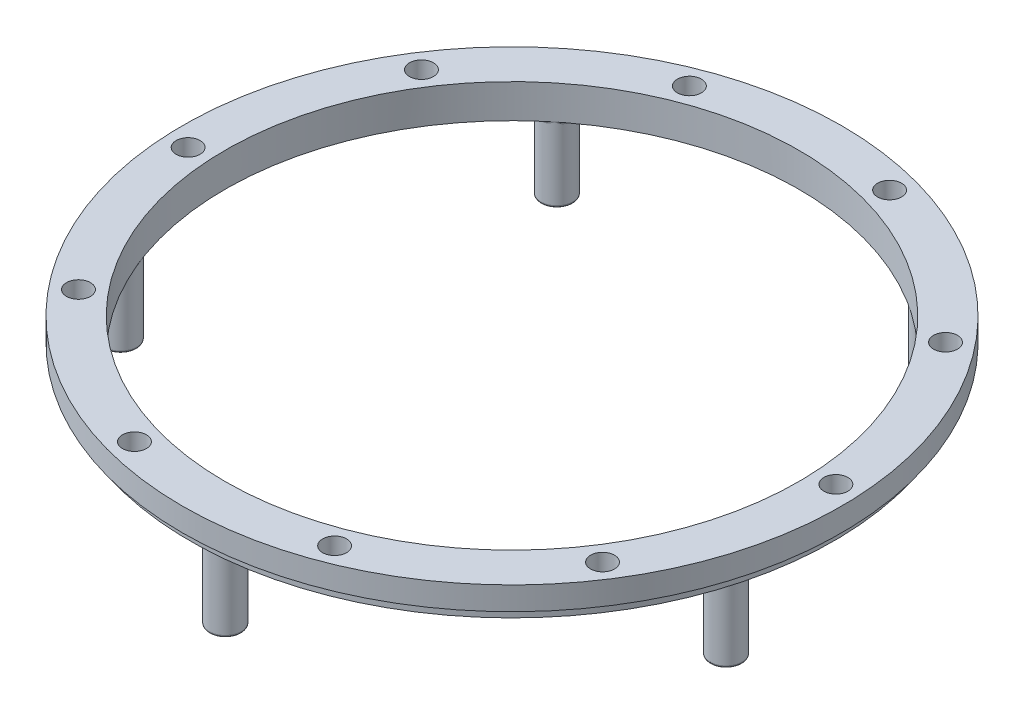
ISO-10303-21;
HEADER;
FILE_DESCRIPTION(('STEP AP214'),'2;1');
FILE_NAME('part.step','',(''),(''),'','','');
FILE_SCHEMA(('AUTOMOTIVE_DESIGN { 1 0 10303 214 1 1 1 1 }'));
ENDSEC;
DATA;
#1=APPLICATION_CONTEXT('core data for automotive mechanical design processes');
#2=APPLICATION_PROTOCOL_DEFINITION('international standard','automotive_design',2000,#1);
#3=PRODUCT_CONTEXT('',#1,'mechanical');
#4=PRODUCT('Part','Part','',(#3));
#5=PRODUCT_RELATED_PRODUCT_CATEGORY('part','',(#4));
#6=PRODUCT_DEFINITION_FORMATION('','',#4);
#7=PRODUCT_DEFINITION_CONTEXT('part definition',#1,'design');
#8=PRODUCT_DEFINITION('design','',#6,#7);
#9=PRODUCT_DEFINITION_SHAPE('','',#8);
#10=(LENGTH_UNIT() NAMED_UNIT(*) SI_UNIT(.MILLI.,.METRE.));
#11=(NAMED_UNIT(*) PLANE_ANGLE_UNIT() SI_UNIT($,.RADIAN.));
#12=(NAMED_UNIT(*) SI_UNIT($,.STERADIAN.) SOLID_ANGLE_UNIT());
#13=UNCERTAINTY_MEASURE_WITH_UNIT(LENGTH_MEASURE(1.E-05),#10,'distance_accuracy_value','');
#14=(GEOMETRIC_REPRESENTATION_CONTEXT(3) GLOBAL_UNCERTAINTY_ASSIGNED_CONTEXT((#13)) GLOBAL_UNIT_ASSIGNED_CONTEXT((#10,
#11,#12)) REPRESENTATION_CONTEXT('',''));
#15=CARTESIAN_POINT('',(0.,0.,0.));
#16=DIRECTION('',(0.,0.,1.));
#17=DIRECTION('',(1.,0.,0.));
#18=AXIS2_PLACEMENT_3D('',#15,#16,#17);
#19=CARTESIAN_POINT('',(0.,-1.5875,0.));
#20=DIRECTION('',(0.,1.,0.));
#21=DIRECTION('',(0.,0.,1.));
#22=AXIS2_PLACEMENT_3D('',#19,#20,#21);
#23=PLANE('',#22);
#24=CARTESIAN_POINT('',(0.,-1.5875,0.));
#25=DIRECTION('',(0.,1.,0.));
#26=DIRECTION('',(0.,0.,1.));
#27=AXIS2_PLACEMENT_3D('',#24,#25,#26);
#28=CIRCLE('',#27,26.925);
#29=CARTESIAN_POINT('',(-17.5374249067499,-1.5875,-20.4302313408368));
#30=VERTEX_POINT('',#29);
#31=CARTESIAN_POINT('',(-25.4073097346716,-1.5875,8.91202766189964));
#32=VERTEX_POINT('',#31);
#33=EDGE_CURVE('E164',#30,#32,#28,.T.);
#34=ORIENTED_EDGE('',*,*,#33,.T.);
#35=CARTESIAN_POINT('',(-26.5395006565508,-1.5875,10.1801537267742));
#36=DIRECTION('',(0.,1.,0.));
#37=DIRECTION('',(0.,0.,1.));
#38=AXIS2_PLACEMENT_3D('',#35,#36,#37);
#39=CIRCLE('',#38,1.7);
#40=CARTESIAN_POINT('',(-24.8496669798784,-1.5875,10.3657935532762));
#41=VERTEX_POINT('',#40);
#42=EDGE_CURVE('E12',#32,#41,#39,.T.);
#43=ORIENTED_EDGE('',*,*,#42,.T.);
#44=CARTESIAN_POINT('',(0.624551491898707,-1.5875,26.9177554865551));
#45=VERTEX_POINT('',#44);
#46=EDGE_CURVE('E159',#41,#45,#28,.T.);
#47=ORIENTED_EDGE('',*,*,#46,.T.);
#48=CARTESIAN_POINT('',(1.48074481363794,-1.5875,28.386405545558));
#49=DIRECTION('',(0.,1.,0.));
#50=DIRECTION('',(0.,0.,1.));
#51=AXIS2_PLACEMENT_3D('',#48,#49,#50);
#52=CIRCLE('',#51,1.7);
#53=CARTESIAN_POINT('',(2.17948610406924,-1.5875,26.8366440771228));
#54=VERTEX_POINT('',#53);
#55=EDGE_CURVE('E332',#45,#54,#52,.T.);
#56=ORIENTED_EDGE('',*,*,#55,.T.);
#57=CARTESIAN_POINT('',(25.7933037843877,-1.5875,7.7240601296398));
#58=VERTEX_POINT('',#57);
#59=EDGE_CURVE('E426',#54,#58,#28,.T.);
#60=ORIENTED_EDGE('',*,*,#59,.T.);
#61=CARTESIAN_POINT('',(27.4546512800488,-1.5875,7.36360971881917));
#62=DIRECTION('',(0.,1.,0.));
#63=DIRECTION('',(0.,0.,1.));
#64=AXIS2_PLACEMENT_3D('',#61,#62,#63);
#65=CIRCLE('',#64,1.7);
#66=CARTESIAN_POINT('',(26.196663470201,-1.5875,6.22016463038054));
#67=VERTEX_POINT('',#66);
#68=EDGE_CURVE('E51',#58,#67,#65,.T.);
#69=ORIENTED_EDGE('',*,*,#68,.T.);
#70=CARTESIAN_POINT('',(15.3165869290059,-1.5875,-22.1440237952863));
#71=VERTEX_POINT('',#70);
#72=EDGE_CURVE('E434',#67,#71,#28,.T.);
#73=ORIENTED_EDGE('',*,*,#72,.T.);
#74=CARTESIAN_POINT('',(15.4871628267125,-1.5875,-23.8354444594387));
#75=DIRECTION('',(0.,1.,0.));
#76=DIRECTION('',(0.,0.,1.));
#77=AXIS2_PLACEMENT_3D('',#74,#75,#76);
#78=CIRCLE('',#77,1.7);
#79=CARTESIAN_POINT('',(14.0109423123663,-1.5875,-22.9923709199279));
#80=VERTEX_POINT('',#79);
#81=EDGE_CURVE('E66',#71,#80,#78,.T.);
#82=ORIENTED_EDGE('',*,*,#81,.T.);
#83=CARTESIAN_POINT('',(-16.3271324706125,-1.5875,-21.4098194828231));
#84=VERTEX_POINT('',#83);
#85=EDGE_CURVE('E420',#80,#84,#28,.T.);
#86=ORIENTED_EDGE('',*,*,#85,.T.);
#87=CARTESIAN_POINT('',(-17.883058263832,-1.5875,-22.0947245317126));
#88=DIRECTION('',(0.,1.,0.));
#89=DIRECTION('',(0.,0.,1.));
#90=AXIS2_PLACEMENT_3D('',#87,#88,#89);
#91=CIRCLE('',#90,1.7);
#92=EDGE_CURVE('E330',#84,#30,#91,.T.);
#93=ORIENTED_EDGE('',*,*,#92,.T.);
#94=EDGE_LOOP('',(#34,#43,#47,#56,#60,#69,#73,#82,#86,#93));
#95=FACE_BOUND('',#94,.T.);
#96=CARTESIAN_POINT('',(7.49313671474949,-1.5875,-27.9375827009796));
#97=DIRECTION('',(0.,1.,0.));
#98=DIRECTION('',(0.,0.,1.));
#99=AXIS2_PLACEMENT_3D('',#96,#97,#98);
#100=CIRCLE('',#99,1.125);
#101=CARTESIAN_POINT('',(7.49313671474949,-1.5875,-26.8125827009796));
#102=VERTEX_POINT('',#101);
#103=EDGE_CURVE('E568',#102,#102,#100,.T.);
#104=ORIENTED_EDGE('',*,*,#103,.T.);
#105=EDGE_LOOP('',(#104));
#106=FACE_BOUND('',#105,.T.);
#107=CARTESIAN_POINT('',(22.4833740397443,-1.5875,-18.197623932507));
#108=DIRECTION('',(0.,1.,0.));
#109=DIRECTION('',(0.,0.,1.));
#110=AXIS2_PLACEMENT_3D('',#107,#108,#109);
#111=CIRCLE('',#110,1.125);
#112=CARTESIAN_POINT('',(22.4833740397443,-1.5875,-17.072623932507));
#113=VERTEX_POINT('',#112);
#114=EDGE_CURVE('E517',#113,#113,#111,.T.);
#115=ORIENTED_EDGE('',*,*,#114,.T.);
#116=EDGE_LOOP('',(#115));
#117=FACE_BOUND('',#116,.T.);
#118=CARTESIAN_POINT('',(28.8857266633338,-1.5875,-1.50679133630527));
#119=DIRECTION('',(0.,1.,0.));
#120=DIRECTION('',(0.,0.,1.));
#121=AXIS2_PLACEMENT_3D('',#118,#119,#120);
#122=CIRCLE('',#121,1.125);
#123=CARTESIAN_POINT('',(28.8857266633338,-1.5875,-0.381791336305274));
#124=VERTEX_POINT('',#123);
#125=EDGE_CURVE('E524',#124,#124,#122,.T.);
#126=ORIENTED_EDGE('',*,*,#125,.T.);
#127=EDGE_LOOP('',(#126));
#128=FACE_BOUND('',#127,.T.);
#129=CARTESIAN_POINT('',(24.2547134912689,-1.5875,15.7595843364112));
#130=DIRECTION('',(0.,1.,0.));
#131=DIRECTION('',(0.,0.,1.));
#132=AXIS2_PLACEMENT_3D('',#129,#130,#131);
#133=CIRCLE('',#132,1.125);
#134=CARTESIAN_POINT('',(24.2547134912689,-1.5875,16.8845843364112));
#135=VERTEX_POINT('',#134);
#136=EDGE_CURVE('E530',#135,#135,#133,.T.);
#137=ORIENTED_EDGE('',*,*,#136,.T.);
#138=EDGE_LOOP('',(#137));
#139=FACE_BOUND('',#138,.T.);
#140=CARTESIAN_POINT('',(10.3592241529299,-1.5875,27.006334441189));
#141=DIRECTION('',(0.,1.,0.));
#142=DIRECTION('',(0.,0.,1.));
#143=AXIS2_PLACEMENT_3D('',#140,#141,#142);
#144=CIRCLE('',#143,1.125);
#145=CARTESIAN_POINT('',(10.3592241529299,-1.5875,28.131334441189));
#146=VERTEX_POINT('',#145);
#147=EDGE_CURVE('E536',#146,#146,#144,.T.);
#148=ORIENTED_EDGE('',*,*,#147,.T.);
#149=EDGE_LOOP('',(#148));
#150=FACE_BOUND('',#149,.T.);
#151=CARTESIAN_POINT('',(-7.49313671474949,-1.5875,27.9375827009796));
#152=DIRECTION('',(0.,1.,0.));
#153=DIRECTION('',(0.,0.,1.));
#154=AXIS2_PLACEMENT_3D('',#151,#152,#153);
#155=CIRCLE('',#154,1.125);
#156=CARTESIAN_POINT('',(-7.49313671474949,-1.5875,29.0625827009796));
#157=VERTEX_POINT('',#156);
#158=EDGE_CURVE('E542',#157,#157,#155,.T.);
#159=ORIENTED_EDGE('',*,*,#158,.T.);
#160=EDGE_LOOP('',(#159));
#161=FACE_BOUND('',#160,.T.);
#162=CARTESIAN_POINT('',(-22.4833740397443,-1.5875,18.197623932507));
#163=DIRECTION('',(0.,1.,0.));
#164=DIRECTION('',(0.,0.,1.));
#165=AXIS2_PLACEMENT_3D('',#162,#163,#164);
#166=CIRCLE('',#165,1.125);
#167=CARTESIAN_POINT('',(-22.4833740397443,-1.5875,19.322623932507));
#168=VERTEX_POINT('',#167);
#169=EDGE_CURVE('E548',#168,#168,#166,.T.);
#170=ORIENTED_EDGE('',*,*,#169,.T.);
#171=EDGE_LOOP('',(#170));
#172=FACE_BOUND('',#171,.T.);
#173=CARTESIAN_POINT('',(-28.8857266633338,-1.5875,1.50679133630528));
#174=DIRECTION('',(0.,1.,0.));
#175=DIRECTION('',(0.,0.,1.));
#176=AXIS2_PLACEMENT_3D('',#173,#174,#175);
#177=CIRCLE('',#176,1.125);
#178=CARTESIAN_POINT('',(-28.8857266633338,-1.5875,2.63179133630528));
#179=VERTEX_POINT('',#178);
#180=EDGE_CURVE('E554',#179,#179,#177,.T.);
#181=ORIENTED_EDGE('',*,*,#180,.T.);
#182=EDGE_LOOP('',(#181));
#183=FACE_BOUND('',#182,.T.);
#184=CARTESIAN_POINT('',(-24.2547134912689,-1.5875,-15.7595843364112));
#185=DIRECTION('',(0.,1.,0.));
#186=DIRECTION('',(0.,0.,1.));
#187=AXIS2_PLACEMENT_3D('',#184,#185,#186);
#188=CIRCLE('',#187,1.125);
#189=CARTESIAN_POINT('',(-24.2547134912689,-1.5875,-14.6345843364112));
#190=VERTEX_POINT('',#189);
#191=EDGE_CURVE('E560',#190,#190,#188,.T.);
#192=ORIENTED_EDGE('',*,*,#191,.T.);
#193=EDGE_LOOP('',(#192));
#194=FACE_BOUND('',#193,.T.);
#195=CARTESIAN_POINT('',(-10.3592241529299,-1.5875,-27.006334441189));
#196=DIRECTION('',(0.,1.,0.));
#197=DIRECTION('',(0.,0.,1.));
#198=AXIS2_PLACEMENT_3D('',#195,#196,#197);
#199=CIRCLE('',#198,1.125);
#200=CARTESIAN_POINT('',(-10.3592241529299,-1.5875,-25.881334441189));
#201=VERTEX_POINT('',#200);
#202=EDGE_CURVE('E510',#201,#201,#199,.T.);
#203=ORIENTED_EDGE('',*,*,#202,.T.);
#204=EDGE_LOOP('',(#203));
#205=FACE_BOUND('',#204,.T.);
#206=CARTESIAN_POINT('',(0.,-1.5875,0.));
#207=DIRECTION('',(0.,-1.,0.));
#208=DIRECTION('',(0.,0.,-1.));
#209=AXIS2_PLACEMENT_3D('',#206,#207,#208);
#210=CIRCLE('',#209,30.225);
#211=CARTESIAN_POINT('',(0.,-1.5875,-30.225));
#212=VERTEX_POINT('',#211);
#213=EDGE_CURVE('E513',#212,#212,#210,.T.);
#214=ORIENTED_EDGE('',*,*,#213,.T.);
#215=EDGE_LOOP('',(#214));
#216=FACE_BOUND('',#215,.T.);
#217=ADVANCED_FACE('F39',(#95,#106,#117,#128,#139,#150,#161,#172,#183,#194,#205,#216),#23,.F.);
#218=CARTESIAN_POINT('',(0.,1.5875,0.));
#219=DIRECTION('',(0.,-1.,0.));
#220=DIRECTION('',(0.,0.,-1.));
#221=AXIS2_PLACEMENT_3D('',#218,#219,#220);
#222=CYLINDRICAL_SURFACE('',#221,30.925);
#223=CARTESIAN_POINT('',(0.,1.5875,0.));
#224=DIRECTION('',(0.,1.,0.));
#225=DIRECTION('',(0.,0.,1.));
#226=AXIS2_PLACEMENT_3D('',#223,#224,#225);
#227=CIRCLE('',#226,30.925);
#228=CARTESIAN_POINT('',(0.,1.5875,30.925));
#229=VERTEX_POINT('',#228);
#230=EDGE_CURVE('E429',#229,#229,#227,.T.);
#231=ORIENTED_EDGE('',*,*,#230,.F.);
#232=EDGE_LOOP('',(#231));
#233=FACE_BOUND('',#232,.T.);
#234=CARTESIAN_POINT('',(0.,-0.5875,0.));
#235=DIRECTION('',(0.,-1.,0.));
#236=DIRECTION('',(0.,0.,-1.));
#237=AXIS2_PLACEMENT_3D('',#234,#235,#236);
#238=CIRCLE('',#237,30.925);
#239=CARTESIAN_POINT('',(0.,-0.5875,-30.925));
#240=VERTEX_POINT('',#239);
#241=EDGE_CURVE('E504',#240,#240,#238,.T.);
#242=ORIENTED_EDGE('',*,*,#241,.F.);
#243=EDGE_LOOP('',(#242));
#244=FACE_BOUND('',#243,.T.);
#245=ADVANCED_FACE('F491',(#233,#244),#222,.T.);
#246=CARTESIAN_POINT('',(0.,1.5875,0.));
#247=DIRECTION('',(0.,1.,0.));
#248=DIRECTION('',(0.,0.,1.));
#249=AXIS2_PLACEMENT_3D('',#246,#247,#248);
#250=PLANE('',#249);
#251=CARTESIAN_POINT('',(-10.3592241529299,1.5875,-27.006334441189));
#252=DIRECTION('',(0.,1.,0.));
#253=DIRECTION('',(0.,0.,1.));
#254=AXIS2_PLACEMENT_3D('',#251,#252,#253);
#255=CIRCLE('',#254,1.125);
#256=CARTESIAN_POINT('',(-10.3592241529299,1.5875,-25.881334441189));
#257=VERTEX_POINT('',#256);
#258=EDGE_CURVE('E506',#257,#257,#255,.T.);
#259=ORIENTED_EDGE('',*,*,#258,.F.);
#260=EDGE_LOOP('',(#259));
#261=FACE_BOUND('',#260,.T.);
#262=CARTESIAN_POINT('',(-24.2547134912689,1.5875,-15.7595843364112));
#263=DIRECTION('',(0.,1.,0.));
#264=DIRECTION('',(0.,0.,1.));
#265=AXIS2_PLACEMENT_3D('',#262,#263,#264);
#266=CIRCLE('',#265,1.125);
#267=CARTESIAN_POINT('',(-24.2547134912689,1.5875,-14.6345843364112));
#268=VERTEX_POINT('',#267);
#269=EDGE_CURVE('E563',#268,#268,#266,.T.);
#270=ORIENTED_EDGE('',*,*,#269,.F.);
#271=EDGE_LOOP('',(#270));
#272=FACE_BOUND('',#271,.T.);
#273=CARTESIAN_POINT('',(-28.8857266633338,1.5875,1.50679133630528));
#274=DIRECTION('',(0.,1.,0.));
#275=DIRECTION('',(0.,0.,1.));
#276=AXIS2_PLACEMENT_3D('',#273,#274,#275);
#277=CIRCLE('',#276,1.125);
#278=CARTESIAN_POINT('',(-28.8857266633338,1.5875,2.63179133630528));
#279=VERTEX_POINT('',#278);
#280=EDGE_CURVE('E557',#279,#279,#277,.T.);
#281=ORIENTED_EDGE('',*,*,#280,.F.);
#282=EDGE_LOOP('',(#281));
#283=FACE_BOUND('',#282,.T.);
#284=CARTESIAN_POINT('',(-22.4833740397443,1.5875,18.197623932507));
#285=DIRECTION('',(0.,1.,0.));
#286=DIRECTION('',(0.,0.,1.));
#287=AXIS2_PLACEMENT_3D('',#284,#285,#286);
#288=CIRCLE('',#287,1.125);
#289=CARTESIAN_POINT('',(-22.4833740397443,1.5875,19.322623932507));
#290=VERTEX_POINT('',#289);
#291=EDGE_CURVE('E551',#290,#290,#288,.T.);
#292=ORIENTED_EDGE('',*,*,#291,.F.);
#293=EDGE_LOOP('',(#292));
#294=FACE_BOUND('',#293,.T.);
#295=CARTESIAN_POINT('',(-7.49313671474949,1.5875,27.9375827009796));
#296=DIRECTION('',(0.,1.,0.));
#297=DIRECTION('',(0.,0.,1.));
#298=AXIS2_PLACEMENT_3D('',#295,#296,#297);
#299=CIRCLE('',#298,1.125);
#300=CARTESIAN_POINT('',(-7.49313671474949,1.5875,29.0625827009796));
#301=VERTEX_POINT('',#300);
#302=EDGE_CURVE('E545',#301,#301,#299,.T.);
#303=ORIENTED_EDGE('',*,*,#302,.F.);
#304=EDGE_LOOP('',(#303));
#305=FACE_BOUND('',#304,.T.);
#306=CARTESIAN_POINT('',(10.3592241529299,1.5875,27.006334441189));
#307=DIRECTION('',(0.,1.,0.));
#308=DIRECTION('',(0.,0.,1.));
#309=AXIS2_PLACEMENT_3D('',#306,#307,#308);
#310=CIRCLE('',#309,1.125);
#311=CARTESIAN_POINT('',(10.3592241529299,1.5875,28.131334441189));
#312=VERTEX_POINT('',#311);
#313=EDGE_CURVE('E539',#312,#312,#310,.T.);
#314=ORIENTED_EDGE('',*,*,#313,.F.);
#315=EDGE_LOOP('',(#314));
#316=FACE_BOUND('',#315,.T.);
#317=CARTESIAN_POINT('',(24.2547134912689,1.5875,15.7595843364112));
#318=DIRECTION('',(0.,1.,0.));
#319=DIRECTION('',(0.,0.,1.));
#320=AXIS2_PLACEMENT_3D('',#317,#318,#319);
#321=CIRCLE('',#320,1.125);
#322=CARTESIAN_POINT('',(24.2547134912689,1.5875,16.8845843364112));
#323=VERTEX_POINT('',#322);
#324=EDGE_CURVE('E533',#323,#323,#321,.T.);
#325=ORIENTED_EDGE('',*,*,#324,.F.);
#326=EDGE_LOOP('',(#325));
#327=FACE_BOUND('',#326,.T.);
#328=CARTESIAN_POINT('',(28.8857266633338,1.5875,-1.50679133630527));
#329=DIRECTION('',(0.,1.,0.));
#330=DIRECTION('',(0.,0.,1.));
#331=AXIS2_PLACEMENT_3D('',#328,#329,#330);
#332=CIRCLE('',#331,1.125);
#333=CARTESIAN_POINT('',(28.8857266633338,1.5875,-0.381791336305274));
#334=VERTEX_POINT('',#333);
#335=EDGE_CURVE('E527',#334,#334,#332,.T.);
#336=ORIENTED_EDGE('',*,*,#335,.F.);
#337=EDGE_LOOP('',(#336));
#338=FACE_BOUND('',#337,.T.);
#339=CARTESIAN_POINT('',(22.4833740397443,1.5875,-18.197623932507));
#340=DIRECTION('',(0.,1.,0.));
#341=DIRECTION('',(0.,0.,1.));
#342=AXIS2_PLACEMENT_3D('',#339,#340,#341);
#343=CIRCLE('',#342,1.125);
#344=CARTESIAN_POINT('',(22.4833740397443,1.5875,-17.072623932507));
#345=VERTEX_POINT('',#344);
#346=EDGE_CURVE('E521',#345,#345,#343,.T.);
#347=ORIENTED_EDGE('',*,*,#346,.F.);
#348=EDGE_LOOP('',(#347));
#349=FACE_BOUND('',#348,.T.);
#350=CARTESIAN_POINT('',(7.49313671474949,1.5875,-27.9375827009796));
#351=DIRECTION('',(0.,1.,0.));
#352=DIRECTION('',(0.,0.,1.));
#353=AXIS2_PLACEMENT_3D('',#350,#351,#352);
#354=CIRCLE('',#353,1.125);
#355=CARTESIAN_POINT('',(7.49313671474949,1.5875,-26.8125827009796));
#356=VERTEX_POINT('',#355);
#357=EDGE_CURVE('E520',#356,#356,#354,.T.);
#358=ORIENTED_EDGE('',*,*,#357,.F.);
#359=EDGE_LOOP('',(#358));
#360=FACE_BOUND('',#359,.T.);
#361=ORIENTED_EDGE('',*,*,#230,.T.);
#362=EDGE_LOOP('',(#361));
#363=FACE_BOUND('',#362,.T.);
#364=CARTESIAN_POINT('',(0.,1.5875,0.));
#365=DIRECTION('',(0.,1.,0.));
#366=DIRECTION('',(0.,0.,1.));
#367=AXIS2_PLACEMENT_3D('',#364,#365,#366);
#368=CIRCLE('',#367,26.925);
#369=CARTESIAN_POINT('',(0.,1.5875,26.925));
#370=VERTEX_POINT('',#369);
#371=EDGE_CURVE('E425',#370,#370,#368,.T.);
#372=ORIENTED_EDGE('',*,*,#371,.F.);
#373=EDGE_LOOP('',(#372));
#374=FACE_BOUND('',#373,.T.);
#375=ADVANCED_FACE('F355',(#261,#272,#283,#294,#305,#316,#327,#338,#349,#360,#363,#374),#250,.T.);
#376=CARTESIAN_POINT('',(0.,1.5875,0.));
#377=DIRECTION('',(0.,-1.,0.));
#378=DIRECTION('',(0.,0.,-1.));
#379=AXIS2_PLACEMENT_3D('',#376,#377,#378);
#380=CYLINDRICAL_SURFACE('',#379,26.925);
#381=ORIENTED_EDGE('',*,*,#371,.T.);
#382=EDGE_LOOP('',(#381));
#383=FACE_BOUND('',#382,.T.);
#384=CARTESIAN_POINT('',(1.40260524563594,-1.5875,26.8884421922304));
#385=VERTEX_POINT('',#384);
#386=EDGE_CURVE('E421',#385,#54,#28,.T.);
#387=ORIENTED_EDGE('',*,*,#386,.F.);
#388=EDGE_CURVE('E432',#45,#385,#28,.T.);
#389=ORIENTED_EDGE('',*,*,#388,.F.);
#390=ORIENTED_EDGE('',*,*,#46,.F.);
#391=CARTESIAN_POINT('',(-25.138999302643,-1.5875,9.64294244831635));
#392=VERTEX_POINT('',#391);
#393=EDGE_CURVE('E152',#392,#41,#28,.T.);
#394=ORIENTED_EDGE('',*,*,#393,.F.);
#395=EDGE_CURVE('E156',#32,#392,#28,.T.);
#396=ORIENTED_EDGE('',*,*,#395,.F.);
#397=ORIENTED_EDGE('',*,*,#33,.F.);
#398=CARTESIAN_POINT('',(-16.9393612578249,-1.5875,-20.9287760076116));
#399=VERTEX_POINT('',#398);
#400=EDGE_CURVE('E163',#399,#30,#28,.T.);
#401=ORIENTED_EDGE('',*,*,#400,.F.);
#402=EDGE_CURVE('E59',#84,#399,#28,.T.);
#403=ORIENTED_EDGE('',*,*,#402,.F.);
#404=ORIENTED_EDGE('',*,*,#85,.F.);
#405=CARTESIAN_POINT('',(14.6698982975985,-1.5875,-22.5776373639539));
#406=VERTEX_POINT('',#405);
#407=EDGE_CURVE('E419',#406,#80,#28,.T.);
#408=ORIENTED_EDGE('',*,*,#407,.F.);
#409=EDGE_CURVE('E422',#71,#406,#28,.T.);
#410=ORIENTED_EDGE('',*,*,#409,.F.);
#411=ORIENTED_EDGE('',*,*,#72,.F.);
#412=CARTESIAN_POINT('',(26.0058570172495,-1.5875,6.97502873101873));
#413=VERTEX_POINT('',#412);
#414=EDGE_CURVE('E427',#413,#67,#28,.T.);
#415=ORIENTED_EDGE('',*,*,#414,.F.);
#416=EDGE_CURVE('E431',#58,#413,#28,.T.);
#417=ORIENTED_EDGE('',*,*,#416,.F.);
#418=ORIENTED_EDGE('',*,*,#59,.F.);
#419=EDGE_LOOP('',(#387,#389,#390,#394,#396,#397,#401,#403,#404,#408,#410,#411,#415,#417,#418));
#420=FACE_BOUND('',#419,.T.);
#421=ADVANCED_FACE('F154',(#383,#420),#380,.F.);
#422=CARTESIAN_POINT('',(7.49313671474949,-1.5875,-27.9375827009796));
#423=DIRECTION('',(0.,1.,0.));
#424=DIRECTION('',(0.,0.,1.));
#425=AXIS2_PLACEMENT_3D('',#422,#423,#424);
#426=CYLINDRICAL_SURFACE('',#425,1.125);
#427=ORIENTED_EDGE('',*,*,#103,.F.);
#428=EDGE_LOOP('',(#427));
#429=FACE_BOUND('',#428,.T.);
#430=ORIENTED_EDGE('',*,*,#357,.T.);
#431=EDGE_LOOP('',(#430));
#432=FACE_BOUND('',#431,.T.);
#433=ADVANCED_FACE('F354',(#429,#432),#426,.F.);
#434=CARTESIAN_POINT('',(22.4833740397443,-1.5875,-18.197623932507));
#435=DIRECTION('',(0.,1.,0.));
#436=DIRECTION('',(0.,0.,1.));
#437=AXIS2_PLACEMENT_3D('',#434,#435,#436);
#438=CYLINDRICAL_SURFACE('',#437,1.125);
#439=ORIENTED_EDGE('',*,*,#114,.F.);
#440=EDGE_LOOP('',(#439));
#441=FACE_BOUND('',#440,.T.);
#442=ORIENTED_EDGE('',*,*,#346,.T.);
#443=EDGE_LOOP('',(#442));
#444=FACE_BOUND('',#443,.T.);
#445=ADVANCED_FACE('F732',(#441,#444),#438,.F.);
#446=CARTESIAN_POINT('',(28.8857266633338,-1.5875,-1.50679133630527));
#447=DIRECTION('',(0.,1.,0.));
#448=DIRECTION('',(0.,0.,1.));
#449=AXIS2_PLACEMENT_3D('',#446,#447,#448);
#450=CYLINDRICAL_SURFACE('',#449,1.125);
#451=ORIENTED_EDGE('',*,*,#125,.F.);
#452=EDGE_LOOP('',(#451));
#453=FACE_BOUND('',#452,.T.);
#454=ORIENTED_EDGE('',*,*,#335,.T.);
#455=EDGE_LOOP('',(#454));
#456=FACE_BOUND('',#455,.T.);
#457=ADVANCED_FACE('F723',(#453,#456),#450,.F.);
#458=CARTESIAN_POINT('',(24.2547134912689,-1.5875,15.7595843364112));
#459=DIRECTION('',(0.,1.,0.));
#460=DIRECTION('',(0.,0.,1.));
#461=AXIS2_PLACEMENT_3D('',#458,#459,#460);
#462=CYLINDRICAL_SURFACE('',#461,1.125);
#463=ORIENTED_EDGE('',*,*,#136,.F.);
#464=EDGE_LOOP('',(#463));
#465=FACE_BOUND('',#464,.T.);
#466=ORIENTED_EDGE('',*,*,#324,.T.);
#467=EDGE_LOOP('',(#466));
#468=FACE_BOUND('',#467,.T.);
#469=ADVANCED_FACE('F714',(#465,#468),#462,.F.);
#470=CARTESIAN_POINT('',(10.3592241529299,-1.5875,27.006334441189));
#471=DIRECTION('',(0.,1.,0.));
#472=DIRECTION('',(0.,0.,1.));
#473=AXIS2_PLACEMENT_3D('',#470,#471,#472);
#474=CYLINDRICAL_SURFACE('',#473,1.125);
#475=ORIENTED_EDGE('',*,*,#147,.F.);
#476=EDGE_LOOP('',(#475));
#477=FACE_BOUND('',#476,.T.);
#478=ORIENTED_EDGE('',*,*,#313,.T.);
#479=EDGE_LOOP('',(#478));
#480=FACE_BOUND('',#479,.T.);
#481=ADVANCED_FACE('F705',(#477,#480),#474,.F.);
#482=CARTESIAN_POINT('',(-7.49313671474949,-1.5875,27.9375827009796));
#483=DIRECTION('',(0.,1.,0.));
#484=DIRECTION('',(0.,0.,1.));
#485=AXIS2_PLACEMENT_3D('',#482,#483,#484);
#486=CYLINDRICAL_SURFACE('',#485,1.125);
#487=ORIENTED_EDGE('',*,*,#158,.F.);
#488=EDGE_LOOP('',(#487));
#489=FACE_BOUND('',#488,.T.);
#490=ORIENTED_EDGE('',*,*,#302,.T.);
#491=EDGE_LOOP('',(#490));
#492=FACE_BOUND('',#491,.T.);
#493=ADVANCED_FACE('F696',(#489,#492),#486,.F.);
#494=CARTESIAN_POINT('',(-22.4833740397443,-1.5875,18.197623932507));
#495=DIRECTION('',(0.,1.,0.));
#496=DIRECTION('',(0.,0.,1.));
#497=AXIS2_PLACEMENT_3D('',#494,#495,#496);
#498=CYLINDRICAL_SURFACE('',#497,1.125);
#499=ORIENTED_EDGE('',*,*,#169,.F.);
#500=EDGE_LOOP('',(#499));
#501=FACE_BOUND('',#500,.T.);
#502=ORIENTED_EDGE('',*,*,#291,.T.);
#503=EDGE_LOOP('',(#502));
#504=FACE_BOUND('',#503,.T.);
#505=ADVANCED_FACE('F687',(#501,#504),#498,.F.);
#506=CARTESIAN_POINT('',(-28.8857266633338,-1.5875,1.50679133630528));
#507=DIRECTION('',(0.,1.,0.));
#508=DIRECTION('',(0.,0.,1.));
#509=AXIS2_PLACEMENT_3D('',#506,#507,#508);
#510=CYLINDRICAL_SURFACE('',#509,1.125);
#511=ORIENTED_EDGE('',*,*,#180,.F.);
#512=EDGE_LOOP('',(#511));
#513=FACE_BOUND('',#512,.T.);
#514=ORIENTED_EDGE('',*,*,#280,.T.);
#515=EDGE_LOOP('',(#514));
#516=FACE_BOUND('',#515,.T.);
#517=ADVANCED_FACE('F678',(#513,#516),#510,.F.);
#518=CARTESIAN_POINT('',(-24.2547134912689,-1.5875,-15.7595843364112));
#519=DIRECTION('',(0.,1.,0.));
#520=DIRECTION('',(0.,0.,1.));
#521=AXIS2_PLACEMENT_3D('',#518,#519,#520);
#522=CYLINDRICAL_SURFACE('',#521,1.125);
#523=ORIENTED_EDGE('',*,*,#191,.F.);
#524=EDGE_LOOP('',(#523));
#525=FACE_BOUND('',#524,.T.);
#526=ORIENTED_EDGE('',*,*,#269,.T.);
#527=EDGE_LOOP('',(#526));
#528=FACE_BOUND('',#527,.T.);
#529=ADVANCED_FACE('F670',(#525,#528),#522,.F.);
#530=CARTESIAN_POINT('',(-10.3592241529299,-1.5875,-27.006334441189));
#531=DIRECTION('',(0.,1.,0.));
#532=DIRECTION('',(0.,0.,1.));
#533=AXIS2_PLACEMENT_3D('',#530,#531,#532);
#534=CYLINDRICAL_SURFACE('',#533,1.125);
#535=ORIENTED_EDGE('',*,*,#202,.F.);
#536=EDGE_LOOP('',(#535));
#537=FACE_BOUND('',#536,.T.);
#538=ORIENTED_EDGE('',*,*,#258,.T.);
#539=EDGE_LOOP('',(#538));
#540=FACE_BOUND('',#539,.T.);
#541=ADVANCED_FACE('F662',(#537,#540),#534,.F.);
#542=CARTESIAN_POINT('',(1.48074481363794,-8.5875,28.386405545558));
#543=DIRECTION('',(0.,1.,0.));
#544=DIRECTION('',(0.,0.,1.));
#545=AXIS2_PLACEMENT_3D('',#542,#543,#544);
#546=CYLINDRICAL_SURFACE('',#545,1.5);
#547=CARTESIAN_POINT('',(1.48074481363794,-8.3875,28.386405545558));
#548=DIRECTION('',(0.,-1.,0.));
#549=DIRECTION('',(0.,0.,-1.));
#550=AXIS2_PLACEMENT_3D('',#547,#548,#549);
#551=CIRCLE('',#550,1.5);
#552=CARTESIAN_POINT('',(1.48074481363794,-8.3875,26.886405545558));
#553=VERTEX_POINT('',#552);
#554=EDGE_CURVE('E1045',#553,#553,#551,.F.);
#555=ORIENTED_EDGE('',*,*,#554,.T.);
#556=EDGE_LOOP('',(#555));
#557=FACE_BOUND('',#556,.T.);
#558=CARTESIAN_POINT('',(0.606314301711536,-1.76873226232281,27.1676474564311));
#559=CARTESIAN_POINT('',(0.666204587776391,-1.49074797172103,27.124677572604));
#560=CARTESIAN_POINT('',(0.488189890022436,-1.5875,26.9205738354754));
#561=CARTESIAN_POINT('',(0.617058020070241,-1.77269514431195,27.1599366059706));
#562=CARTESIAN_POINT('',(0.667452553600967,-1.50237274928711,27.1245529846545));
#563=CARTESIAN_POINT('',(0.50048174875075,-1.5875,26.9203510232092));
#564=CARTESIAN_POINT('',(0.628029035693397,-1.77591694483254,27.1522828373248));
#565=CARTESIAN_POINT('',(0.670408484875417,-1.51361897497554,27.1230807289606));
#566=CARTESIAN_POINT('',(0.513040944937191,-1.5875,26.920114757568));
#567=CARTESIAN_POINT('',(0.65030803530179,-1.78108186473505,27.1371842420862));
#568=CARTESIAN_POINT('',(0.678958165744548,-1.53444364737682,27.1182233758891));
#569=CARTESIAN_POINT('',(0.538558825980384,-1.5875,26.9196162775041));
#570=CARTESIAN_POINT('',(0.661615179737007,-1.78302792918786,27.1297389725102));
#571=CARTESIAN_POINT('',(0.68444379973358,-1.54411969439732,27.114918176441));
#572=CARTESIAN_POINT('',(0.551516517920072,-1.5875,26.9193541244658));
#573=CARTESIAN_POINT('',(0.695710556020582,-1.78724934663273,27.1079517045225));
#574=CARTESIAN_POINT('',(0.703265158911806,-1.56990602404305,27.1035600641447));
#575=CARTESIAN_POINT('',(0.590608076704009,-1.5875,26.9185341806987));
#576=CARTESIAN_POINT('',(0.71889290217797,-1.78797906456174,27.0939998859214));
#577=CARTESIAN_POINT('',(0.719428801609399,-1.5844878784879,27.0937875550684));
#578=CARTESIAN_POINT('',(0.617212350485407,-1.5875,26.9179383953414));
#579=CARTESIAN_POINT('',(0.785556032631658,-1.7858111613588,27.0563048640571));
#580=CARTESIAN_POINT('',(0.769871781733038,-1.61669663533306,27.0650210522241));
#581=CARTESIAN_POINT('',(0.693773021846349,-1.5875,26.9161058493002));
#582=CARTESIAN_POINT('',(0.829802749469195,-1.77937069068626,27.0341280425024));
#583=CARTESIAN_POINT('',(0.809969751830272,-1.63012513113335,27.0437391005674));
#584=CARTESIAN_POINT('',(0.744656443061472,-1.5875,26.9147496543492));
#585=CARTESIAN_POINT('',(0.919660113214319,-1.76052225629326,26.9944178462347));
#586=CARTESIAN_POINT('',(0.895376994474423,-1.64471154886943,27.0043527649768));
#587=CARTESIAN_POINT('',(0.848049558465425,-1.5875,26.9116916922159));
#588=CARTESIAN_POINT('',(0.965279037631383,-1.74806515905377,26.9769245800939));
#589=CARTESIAN_POINT('',(0.941324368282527,-1.64679859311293,26.9856063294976));
#590=CARTESIAN_POINT('',(0.900569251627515,-1.5875,26.909987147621));
#591=CARTESIAN_POINT('',(1.07455153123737,-1.71414345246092,26.9409121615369));
#592=CARTESIAN_POINT('',(1.05191352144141,-1.64354971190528,26.9473488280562));
#593=CARTESIAN_POINT('',(1.0263376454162,-1.5875,26.9055303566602));
#594=CARTESIAN_POINT('',(1.13850205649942,-1.69105397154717,26.9245061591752));
#595=CARTESIAN_POINT('',(1.12011225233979,-1.63570258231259,26.9286038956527));
#596=CARTESIAN_POINT('',(1.09991546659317,-1.5875,26.9026256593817));
#597=CARTESIAN_POINT('',(1.26690375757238,-1.64203227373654,26.9002935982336));
#598=CARTESIAN_POINT('',(1.25629771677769,-1.61489967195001,26.9016841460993));
#599=CARTESIAN_POINT('',(1.2473620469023,-1.5875,26.8961920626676));
#600=CARTESIAN_POINT('',(1.33135278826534,-1.61610901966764,26.8924607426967));
#601=CARTESIAN_POINT('',(1.32626853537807,-1.60180890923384,26.8927728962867));
#602=CARTESIAN_POINT('',(1.32122921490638,-1.5875,26.8926651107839));
#603=CARTESIAN_POINT('',(1.39817740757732,-1.58927764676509,26.8886780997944));
#604=CARTESIAN_POINT('',(1.39786342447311,-1.58838882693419,26.8886950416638));
#605=CARTESIAN_POINT('',(1.39754916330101,-1.5875,26.8887055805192));
#606=CARTESIAN_POINT('',(1.40039123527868,-1.58838880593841,26.88855769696));
#607=CARTESIAN_POINT('',(1.40023425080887,-1.5879443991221,26.8885657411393));
#608=CARTESIAN_POINT('',(1.40007725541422,-1.5875,26.8885740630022));
#609=CARTESIAN_POINT('',(1.40260524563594,-1.5875,26.8884421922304));
#610=CARTESIAN_POINT('',(1.40260524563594,-1.5875,26.8884421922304));
#611=CARTESIAN_POINT('',(1.40260524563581,-1.5875,26.8884421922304));
#612=(BOUNDED_SURFACE() B_SPLINE_SURFACE(3,2,((#558,#559,#560),(#561,#562,#563),(#564,#565,
#566),(#567,#568,#569),(#570,#571,#572),(#573,#574,#575),(#576,#577,#578),(#579,#580,#581),
(#582,#583,#584),(#585,#586,#587),(#588,#589,#590),(#591,#592,#593),(#594,#595,#596),(#597,#598,
#599),(#600,#601,#602),(#603,#604,#605),(#606,#607,#608),(#609,#610,#611)),.UNSPECIFIED.,.F.,
.F.,.F.) B_SPLINE_SURFACE_WITH_KNOTS((4,2,2,2,2,2,2,2,4),(3,3),(0.,0.0464530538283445,
0.0927984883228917,0.184553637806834,0.353023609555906,0.522893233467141,0.756993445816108,
0.990373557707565,0.998369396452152),(0.,1.),
.UNSPECIFIED.) GEOMETRIC_REPRESENTATION_ITEM() RATIONAL_B_SPLINE_SURFACE(((1.,0.570942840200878,
1.),(1.,0.585308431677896,1.),(1.,0.599301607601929,1.),(1.,0.626475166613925,1.),(1.,
0.639657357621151,1.),(1.,0.677725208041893,1.),(1.,0.701422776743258,1.),(1.,0.764223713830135,
1.),(1.,0.799642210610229,1.),(1.,0.861370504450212,1.),(1.,0.887602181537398,1.),(1.,
0.939902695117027,1.),(1.,0.962159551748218,1.),(1.,0.991930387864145,1.),(1.,0.999489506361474,
1.),(1.,0.999991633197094,1.),(1.,0.999999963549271,1.),(1.,1.,1.))) REPRESENTATION_ITEM('') SURFACE());
#613=CARTESIAN_POINT('',(0.606314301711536,-1.76873226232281,27.1676474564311));
#614=CARTESIAN_POINT('',(0.617058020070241,-1.77269514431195,27.1599366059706));
#615=CARTESIAN_POINT('',(0.628029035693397,-1.77591694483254,27.1522828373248));
#616=CARTESIAN_POINT('',(0.65030803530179,-1.78108186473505,27.1371842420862));
#617=CARTESIAN_POINT('',(0.661615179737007,-1.78302792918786,27.1297389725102));
#618=CARTESIAN_POINT('',(0.695710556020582,-1.78724934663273,27.1079517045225));
#619=CARTESIAN_POINT('',(0.71889290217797,-1.78797906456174,27.0939998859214));
#620=CARTESIAN_POINT('',(0.785556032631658,-1.7858111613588,27.0563048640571));
#621=CARTESIAN_POINT('',(0.829802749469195,-1.77937069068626,27.0341280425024));
#622=CARTESIAN_POINT('',(0.919660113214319,-1.76052225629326,26.9944178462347));
#623=CARTESIAN_POINT('',(0.965279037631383,-1.74806515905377,26.9769245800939));
#624=CARTESIAN_POINT('',(1.07455153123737,-1.71414345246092,26.9409121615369));
#625=CARTESIAN_POINT('',(1.13850205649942,-1.69105397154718,26.9245061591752));
#626=CARTESIAN_POINT('',(1.26690375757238,-1.64203227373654,26.9002935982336));
#627=CARTESIAN_POINT('',(1.33135278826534,-1.61610901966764,26.8924607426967));
#628=CARTESIAN_POINT('',(1.39817740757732,-1.58927764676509,26.8886780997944));
#629=CARTESIAN_POINT('',(1.40039123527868,-1.58838880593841,26.88855769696));
#630=CARTESIAN_POINT('',(1.40260524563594,-1.5875,26.8884421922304));
#631=B_SPLINE_CURVE_WITH_KNOTS('',3,(#613,#614,#615,#616,#617,#618,#619,#620,#621,#622,#623,
#624,#625,#626,#627,#628,#629,#630),.UNSPECIFIED.,.F.,.F.,(4,2,2,2,2,2,2,2,4),(0.,
0.0464530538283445,0.0927984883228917,0.184553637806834,0.353023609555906,0.522893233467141,
0.756993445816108,0.990373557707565,0.998369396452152),.UNSPECIFIED.);
#632=CARTESIAN_POINT('',(0.725280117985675,-1.7875,27.0905378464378));
#633=VERTEX_POINT('',#632);
#634=EDGE_CURVE('E1034',#633,#385,#631,.T.);
#635=ORIENTED_EDGE('',*,*,#634,.T.);
#636=CARTESIAN_POINT('',(2.31540086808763,-1.5875,26.8252594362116));
#637=CARTESIAN_POINT('',(2.15958821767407,-1.49074795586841,27.0467769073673));
#638=CARTESIAN_POINT('',(2.22362423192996,-1.76873226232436,27.0832823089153));
#639=CARTESIAN_POINT('',(2.30315253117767,-1.5875,26.8263167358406));
#640=CARTESIAN_POINT('',(2.15833405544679,-1.50237274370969,27.0467828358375));
#641=CARTESIAN_POINT('',(2.21213655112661,-1.77269514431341,27.0767311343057));
#642=CARTESIAN_POINT('',(2.29063691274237,-1.5875,26.8273884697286));
#643=CARTESIAN_POINT('',(2.15524098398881,-1.51361897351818,27.0456261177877));
#644=CARTESIAN_POINT('',(2.20042874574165,-1.77591694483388,27.0702603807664));
#645=CARTESIAN_POINT('',(2.26520565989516,-1.5875,26.8295476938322));
#646=CARTESIAN_POINT('',(2.14623232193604,-1.53444364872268,27.0416846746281));
#647=CARTESIAN_POINT('',(2.17669973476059,-1.78108186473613,27.0575617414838));
#648=CARTESIAN_POINT('',(2.25229101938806,-1.5875,26.8306351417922));
#649=CARTESIAN_POINT('',(2.14043257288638,-1.54411969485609,27.0389681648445));
#650=CARTESIAN_POINT('',(2.16467931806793,-1.78302792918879,27.0513333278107));
#651=CARTESIAN_POINT('',(2.21332631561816,-1.5875,26.8338869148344));
#652=CARTESIAN_POINT('',(2.12053161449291,-1.56990602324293,27.0296299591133));
#653=CARTESIAN_POINT('',(2.12850214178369,-1.78724934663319,27.0332117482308));
#654=CARTESIAN_POINT('',(2.18680444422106,-1.5875,26.8360623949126));
#655=CARTESIAN_POINT('',(2.10343892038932,-1.58448787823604,27.021592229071));
#656=CARTESIAN_POINT('',(2.10399400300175,-1.78797906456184,27.0217476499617));
#657=CARTESIAN_POINT('',(2.11046862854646,-1.5875,26.8422055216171));
#658=CARTESIAN_POINT('',(2.05027671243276,-1.61669663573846,26.9982301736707));
#659=CARTESIAN_POINT('',(2.03377071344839,-1.78581116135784,26.9911931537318));
#660=CARTESIAN_POINT('',(2.05972026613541,-1.5875,26.8461508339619));
#661=CARTESIAN_POINT('',(2.00818209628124,-1.63012513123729,26.9812357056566));
#662=CARTESIAN_POINT('',(1.98745676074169,-1.77937069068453,26.9737403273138));
#663=CARTESIAN_POINT('',(1.95657013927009,-1.5875,26.8538669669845));
#664=CARTESIAN_POINT('',(1.9191404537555,-1.64471154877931,26.9509492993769));
#665=CARTESIAN_POINT('',(1.89395545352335,-1.76052225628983,26.9435948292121));
#666=CARTESIAN_POINT('',(1.90415814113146,-1.5875,26.8576360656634));
#667=CARTESIAN_POINT('',(1.87149198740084,-1.64679859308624,26.9370851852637));
#668=CARTESIAN_POINT('',(1.84676403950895,-1.74806515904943,26.9309429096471));
#669=CARTESIAN_POINT('',(1.77860863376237,-1.5875,26.8662889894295));
#670=CARTESIAN_POINT('',(1.75752255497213,-1.6435497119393,26.9105415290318));
#671=CARTESIAN_POINT('',(1.73433770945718,-1.71414345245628,26.9064951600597));
#672=CARTESIAN_POINT('',(1.70512792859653,-1.5875,26.8710554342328));
#673=CARTESIAN_POINT('',(1.68774365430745,-1.63570258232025,26.8989940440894));
#674=CARTESIAN_POINT('',(1.66902731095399,-1.69105397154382,26.8968319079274));
#675=CARTESIAN_POINT('',(1.5578122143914,-1.5875,26.8799977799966));
#676=CARTESIAN_POINT('',(1.54949646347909,-1.61489967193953,26.8863897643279));
#677=CARTESIAN_POINT('',(1.53880330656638,-1.64203227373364,26.8861102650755));
#678=CARTESIAN_POINT('',(1.48397899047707,-1.5875,26.8841754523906));
#679=CARTESIAN_POINT('',(1.47897823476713,-1.60180890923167,26.8848069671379));
#680=CARTESIAN_POINT('',(1.4738890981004,-1.61610901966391,26.8850254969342));
#681=CARTESIAN_POINT('',(1.40766129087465,-1.5875,26.888178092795));
#682=CARTESIAN_POINT('',(1.4073476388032,-1.58838882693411,26.8882003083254));
#683=CARTESIAN_POINT('',(1.40703359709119,-1.58927764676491,26.8882161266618));
#684=CARTESIAN_POINT('',(1.40513323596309,-1.5875,26.8883103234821));
#685=CARTESIAN_POINT('',(1.40497622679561,-1.58794439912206,26.8883183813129));
#686=CARTESIAN_POINT('',(1.4048192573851,-1.58838880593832,26.8883267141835));
#687=CARTESIAN_POINT('',(1.40260524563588,-1.5875,26.8884421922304));
#688=CARTESIAN_POINT('',(1.40260524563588,-1.5875,26.8884421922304));
#689=CARTESIAN_POINT('',(1.40260524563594,-1.5875,26.8884421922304));
#690=(BOUNDED_SURFACE() B_SPLINE_SURFACE(3,2,((#636,#637,#638),(#639,#640,#641),(#642,#643,
#644),(#645,#646,#647),(#648,#649,#650),(#651,#652,#653),(#654,#655,#656),(#657,#658,#659),
(#660,#661,#662),(#663,#664,#665),(#666,#667,#668),(#669,#670,#671),(#672,#673,#674),(#675,#676,
#677),(#678,#679,#680),(#681,#682,#683),(#684,#685,#686),(#687,#688,#689)),.UNSPECIFIED.,.F.,
.F.,.F.) B_SPLINE_SURFACE_WITH_KNOTS((4,2,2,2,2,2,2,2,4),(3,3),(0.,0.0464530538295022,
0.0927984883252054,0.184553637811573,0.353023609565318,0.522893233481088,0.756993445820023,
0.990373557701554,0.998369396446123),(0.,1.),
.UNSPECIFIED.) GEOMETRIC_REPRESENTATION_ITEM() RATIONAL_B_SPLINE_SURFACE(((1.,0.570942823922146,
1.),(1.,0.5853084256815,1.),(1.,0.599301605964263,1.),(1.,0.626475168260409,1.),(1.,
0.639657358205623,1.),(1.,0.677725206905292,1.),(1.,0.701422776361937,1.),(1.,0.764223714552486,
1.),(1.,0.799642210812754,1.),(1.,0.861370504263,1.),(1.,0.887602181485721,1.),(1.,
0.939902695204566,1.),(1.,0.962159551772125,1.),(1.,0.991930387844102,1.),(1.,0.999489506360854,
1.),(1.,0.99999163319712,1.),(1.,0.999999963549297,1.),(1.,1.,1.))) REPRESENTATION_ITEM('') SURFACE());
#691=CARTESIAN_POINT('',(2.22362423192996,-1.76873226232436,27.0832823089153));
#692=CARTESIAN_POINT('',(2.21213655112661,-1.77269514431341,27.0767311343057));
#693=CARTESIAN_POINT('',(2.20042874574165,-1.77591694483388,27.0702603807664));
#694=CARTESIAN_POINT('',(2.17669973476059,-1.78108186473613,27.0575617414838));
#695=CARTESIAN_POINT('',(2.16467931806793,-1.78302792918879,27.0513333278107));
#696=CARTESIAN_POINT('',(2.12850214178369,-1.78724934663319,27.0332117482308));
#697=CARTESIAN_POINT('',(2.10399400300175,-1.78797906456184,27.0217476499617));
#698=CARTESIAN_POINT('',(2.03377071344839,-1.78581116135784,26.9911931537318));
#699=CARTESIAN_POINT('',(1.98745676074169,-1.77937069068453,26.9737403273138));
#700=CARTESIAN_POINT('',(1.89395545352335,-1.76052225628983,26.9435948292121));
#701=CARTESIAN_POINT('',(1.84676403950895,-1.74806515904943,26.9309429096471));
#702=CARTESIAN_POINT('',(1.73433770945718,-1.71414345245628,26.9064951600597));
#703=CARTESIAN_POINT('',(1.66902731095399,-1.69105397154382,26.8968319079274));
#704=CARTESIAN_POINT('',(1.53880330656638,-1.64203227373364,26.8861102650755));
#705=CARTESIAN_POINT('',(1.47388909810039,-1.61610901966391,26.8850254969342));
#706=CARTESIAN_POINT('',(1.40703359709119,-1.58927764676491,26.8882161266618));
#707=CARTESIAN_POINT('',(1.4048192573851,-1.58838880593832,26.8883267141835));
#708=CARTESIAN_POINT('',(1.40260524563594,-1.5875,26.8884421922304));
#709=B_SPLINE_CURVE_WITH_KNOTS('',3,(#691,#692,#693,#694,#695,#696,#697,#698,#699,#700,#701,
#702,#703,#704,#705,#706,#707,#708),.UNSPECIFIED.,.F.,.F.,(4,2,2,2,2,2,2,2,4),(0.,
0.0464530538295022,0.0927984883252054,0.184553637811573,0.353023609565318,0.522893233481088,
0.756993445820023,0.990373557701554,0.998369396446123),.UNSPECIFIED.);
#710=CARTESIAN_POINT('',(2.09728124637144,-1.7875,27.0189689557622));
#711=VERTEX_POINT('',#710);
#712=EDGE_CURVE('E1040',#385,#711,#709,.F.);
#713=ORIENTED_EDGE('',*,*,#712,.T.);
#714=CARTESIAN_POINT('',(1.48074481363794,-1.7875,28.386405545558));
#715=DIRECTION('',(0.,1.,0.));
#716=DIRECTION('',(0.,0.,1.));
#717=AXIS2_PLACEMENT_3D('',#714,#715,#716);
#718=CIRCLE('',#717,1.5);
#719=EDGE_CURVE('E1039',#711,#633,#718,.F.);
#720=ORIENTED_EDGE('',*,*,#719,.T.);
#721=EDGE_LOOP('',(#635,#713,#720));
#722=FACE_BOUND('',#721,.T.);
#723=ADVANCED_FACE('F238',(#557,#722),#546,.T.);
#724=CARTESIAN_POINT('',(0.,-8.5875,0.));
#725=DIRECTION('',(0.,-1.,0.));
#726=DIRECTION('',(0.,0.,-1.));
#727=AXIS2_PLACEMENT_3D('',#724,#725,#726);
#728=PLANE('',#727);
#729=CARTESIAN_POINT('',(1.48074481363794,-8.5875,28.386405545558));
#730=DIRECTION('',(0.,-1.,0.));
#731=DIRECTION('',(0.,0.,-1.));
#732=AXIS2_PLACEMENT_3D('',#729,#730,#731);
#733=CIRCLE('',#732,1.3);
#734=CARTESIAN_POINT('',(1.48074481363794,-8.5875,27.086405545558));
#735=VERTEX_POINT('',#734);
#736=EDGE_CURVE('E1031',#735,#735,#733,.T.);
#737=ORIENTED_EDGE('',*,*,#736,.T.);
#738=EDGE_LOOP('',(#737));
#739=FACE_BOUND('',#738,.T.);
#740=ADVANCED_FACE('F647',(#739),#728,.T.);
#741=CARTESIAN_POINT('',(27.4546512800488,-8.5875,7.36360971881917));
#742=DIRECTION('',(0.,1.,0.));
#743=DIRECTION('',(0.,0.,1.));
#744=AXIS2_PLACEMENT_3D('',#741,#742,#743);
#745=CYLINDRICAL_SURFACE('',#744,1.5);
#746=CARTESIAN_POINT('',(27.4546512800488,-8.3875,7.36360971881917));
#747=DIRECTION('',(0.,-1.,0.));
#748=DIRECTION('',(0.,0.,-1.));
#749=AXIS2_PLACEMENT_3D('',#746,#747,#748);
#750=CIRCLE('',#749,1.5);
#751=CARTESIAN_POINT('',(27.4546512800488,-8.3875,5.86360971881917));
#752=VERTEX_POINT('',#751);
#753=EDGE_CURVE('E1028',#752,#752,#750,.F.);
#754=ORIENTED_EDGE('',*,*,#753,.T.);
#755=EDGE_LOOP('',(#754));
#756=FACE_BOUND('',#755,.T.);
#757=CARTESIAN_POINT('',(26.0253295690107,-1.76873226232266,7.81862559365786));
#758=CARTESIAN_POINT('',(26.0029698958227,-1.49074797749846,7.74838811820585));
#759=CARTESIAN_POINT('',(25.7538461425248,-1.5875,7.85461863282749));
#760=CARTESIAN_POINT('',(26.0213161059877,-1.77269514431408,7.8060249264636));
#761=CARTESIAN_POINT('',(26.0032370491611,-1.50237275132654,7.74716273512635));
#762=CARTESIAN_POINT('',(25.7574326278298,-1.5875,7.84285953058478));
#763=CARTESIAN_POINT('',(26.017427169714,-1.77591694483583,7.79322572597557));
#764=CARTESIAN_POINT('',(26.0027502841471,-1.51361897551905,7.74389652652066));
#765=CARTESIAN_POINT('',(25.7610889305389,-1.5875,7.83084201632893));
#766=CARTESIAN_POINT('',(26.0099521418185,-1.78108186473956,7.76737141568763));
#767=CARTESIAN_POINT('',(26.0007726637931,-1.53444364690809,7.73426429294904));
#768=CARTESIAN_POINT('',(25.768500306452,-1.5875,7.80641903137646));
#769=CARTESIAN_POINT('',(26.0063653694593,-1.78302792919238,7.75431696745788));
#770=CARTESIAN_POINT('',(25.9993243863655,-1.54411969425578,7.7280257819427));
#771=CARTESIAN_POINT('',(25.7722551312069,-1.5875,7.79401452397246));
#772=CARTESIAN_POINT('',(25.9961804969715,-1.78724934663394,7.71515770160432));
#773=CARTESIAN_POINT('',(25.9943382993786,-1.56990602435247,7.70661575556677));
#774=CARTESIAN_POINT('',(25.7835552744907,-1.5875,7.7565828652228));
#775=CARTESIAN_POINT('',(25.9900752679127,-1.7879790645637,7.68879863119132));
#776=CARTESIAN_POINT('',(25.9900389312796,-1.58448787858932,7.68822334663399));
#777=CARTESIAN_POINT('',(25.7912098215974,-1.5875,7.73109658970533));
#778=CARTESIAN_POINT('',(25.9748252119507,-1.78581116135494,7.61374982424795));
#779=CARTESIAN_POINT('',(25.9782680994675,-1.61669663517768,7.63135988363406));
#780=CARTESIAN_POINT('',(25.8131255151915,-1.5875,7.65771677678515));
#781=CARTESIAN_POINT('',(25.9674067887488,-1.77937069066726,7.5648156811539));
#782=CARTESIAN_POINT('',(25.9704187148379,-1.63012513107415,7.58664796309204));
#783=CARTESIAN_POINT('',(25.8275595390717,-1.5875,7.60890468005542));
#784=CARTESIAN_POINT('',(25.9574076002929,-1.76052225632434,7.46708512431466));
#785=CARTESIAN_POINT('',(25.9593523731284,-1.64471154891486,7.49324980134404));
#786=CARTESIAN_POINT('',(25.8566014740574,-1.5875,7.50962702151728));
#787=CARTESIAN_POINT('',(25.9548675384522,-1.748065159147,7.41829323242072));
#788=CARTESIAN_POINT('',(25.9557219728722,-1.64679859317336,7.44375828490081));
#789=CARTESIAN_POINT('',(25.8712098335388,-1.5875,7.45915109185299));
#790=CARTESIAN_POINT('',(25.9543847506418,-1.71414345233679,7.30324046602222));
#791=CARTESIAN_POINT('',(25.9535108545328,-1.64354971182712,7.32675953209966));
#792=CARTESIAN_POINT('',(25.9058357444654,-1.5875,7.33816101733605));
#793=CARTESIAN_POINT('',(25.9585435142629,-1.69105397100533,7.23735016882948));
#794=CARTESIAN_POINT('',(25.9567579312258,-1.63570258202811,7.25610618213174));
#795=CARTESIAN_POINT('',(25.9258100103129,-1.5875,7.267286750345));
#796=CARTESIAN_POINT('',(25.9751943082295,-1.64203227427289,7.10775080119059));
#797=CARTESIAN_POINT('',(25.9732393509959,-1.61489967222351,7.11826744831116));
#798=CARTESIAN_POINT('',(25.9652547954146,-1.5875,7.12506862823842));
#799=CARTESIAN_POINT('',(25.987660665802,-1.61610902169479,7.04403564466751));
#800=CARTESIAN_POINT('',(25.9863864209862,-1.6018089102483,7.04896751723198));
#801=CARTESIAN_POINT('',(25.9847266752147,-1.5875,7.05372688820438));
#802=CARTESIAN_POINT('',(26.004713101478,-1.58927764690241,6.97931275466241));
#803=CARTESIAN_POINT('',(26.0046321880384,-1.58838882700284,6.97961660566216));
#804=CARTESIAN_POINT('',(26.0045450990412,-1.5875,6.97991874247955));
#805=CARTESIAN_POINT('',(26.0052827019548,-1.5883888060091,6.97717007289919));
#806=CARTESIAN_POINT('',(26.0052418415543,-1.58794439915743,6.97732185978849));
#807=CARTESIAN_POINT('',(26.0052012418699,-1.5875,6.97747374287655));
#808=CARTESIAN_POINT('',(26.0058570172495,-1.5875,6.97502873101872));
#809=CARTESIAN_POINT('',(26.005857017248,-1.5875,6.97502873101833));
#810=CARTESIAN_POINT('',(26.0058570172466,-1.5875,6.97502873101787));
#811=(BOUNDED_SURFACE() B_SPLINE_SURFACE(3,2,((#757,#758,#759),(#760,#761,#762),(#763,#764,
#765),(#766,#767,#768),(#769,#770,#771),(#772,#773,#774),(#775,#776,#777),(#778,#779,#780),
(#781,#782,#783),(#784,#785,#786),(#787,#788,#789),(#790,#791,#792),(#793,#794,#795),(#796,#797,
#798),(#799,#800,#801),(#802,#803,#804),(#805,#806,#807),(#808,#809,#810)),.UNSPECIFIED.,.F.,
.F.,.F.) B_SPLINE_SURFACE_WITH_KNOTS((4,2,2,2,2,2,2,2,4),(3,3),(0.,0.0464530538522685,
0.0927984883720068,0.184553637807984,0.35302360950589,0.522893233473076,0.756993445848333,
0.990373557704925,0.998369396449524),(0.,1.),
.UNSPECIFIED.) GEOMETRIC_REPRESENTATION_ITEM() RATIONAL_B_SPLINE_SURFACE(((1.,0.570942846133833,
1.),(1.,0.585308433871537,1.),(1.,0.59930160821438,1.),(1.,0.626475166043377,1.),(1.,
0.639657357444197,1.),(1.,0.677725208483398,1.),(1.,0.701422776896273,1.),(1.,0.764223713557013,
1.),(1.,0.7996422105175,1.),(1.,0.861370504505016,1.),(1.,0.887602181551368,1.),(1.,
0.939902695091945,1.),(1.,0.962159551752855,1.),(1.,0.99193038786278,1.),(1.,0.9994895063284,
1.),(1.,0.999991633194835,1.),(1.,0.999999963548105,1.),(1.,1.,1.))) REPRESENTATION_ITEM('') SURFACE());
#812=CARTESIAN_POINT('',(26.0253295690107,-1.76873226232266,7.81862559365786));
#813=CARTESIAN_POINT('',(26.0213161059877,-1.77269514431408,7.8060249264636));
#814=CARTESIAN_POINT('',(26.017427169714,-1.77591694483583,7.79322572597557));
#815=CARTESIAN_POINT('',(26.0099521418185,-1.78108186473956,7.76737141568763));
#816=CARTESIAN_POINT('',(26.0063653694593,-1.78302792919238,7.75431696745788));
#817=CARTESIAN_POINT('',(25.9961804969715,-1.78724934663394,7.71515770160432));
#818=CARTESIAN_POINT('',(25.9900752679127,-1.7879790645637,7.68879863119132));
#819=CARTESIAN_POINT('',(25.9748252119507,-1.78581116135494,7.61374982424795));
#820=CARTESIAN_POINT('',(25.9674067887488,-1.77937069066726,7.5648156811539));
#821=CARTESIAN_POINT('',(25.9574076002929,-1.76052225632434,7.46708512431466));
#822=CARTESIAN_POINT('',(25.9548675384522,-1.748065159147,7.41829323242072));
#823=CARTESIAN_POINT('',(25.9543847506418,-1.71414345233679,7.30324046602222));
#824=CARTESIAN_POINT('',(25.9585435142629,-1.69105397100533,7.23735016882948));
#825=CARTESIAN_POINT('',(25.9751943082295,-1.64203227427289,7.10775080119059));
#826=CARTESIAN_POINT('',(25.987660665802,-1.61610902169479,7.04403564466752));
#827=CARTESIAN_POINT('',(26.004713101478,-1.58927764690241,6.9793127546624));
#828=CARTESIAN_POINT('',(26.0052827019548,-1.5883888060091,6.97717007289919));
#829=CARTESIAN_POINT('',(26.0058570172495,-1.5875,6.97502873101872));
#830=B_SPLINE_CURVE_WITH_KNOTS('',3,(#812,#813,#814,#815,#816,#817,#818,#819,#820,#821,#822,
#823,#824,#825,#826,#827,#828,#829),.UNSPECIFIED.,.F.,.F.,(4,2,2,2,2,2,2,2,4),(0.,
0.0464530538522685,0.0927984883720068,0.184553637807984,0.35302360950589,0.522893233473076,
0.756993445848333,0.990373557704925,0.998369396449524),.UNSPECIFIED.);
#831=CARTESIAN_POINT('',(25.9887564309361,-1.7875,7.68165419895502));
#832=VERTEX_POINT('',#831);
#833=EDGE_CURVE('E1014',#832,#413,#830,.T.);
#834=ORIENTED_EDGE('',*,*,#833,.T.);
#835=CARTESIAN_POINT('',(26.2278360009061,-1.5875,6.08738397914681));
#836=CARTESIAN_POINT('',(26.3903628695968,-1.49074797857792,6.3040232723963));
#837=CARTESIAN_POINT('',(26.4448697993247,-1.76873226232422,6.25440218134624));
#838=CARTESIAN_POINT('',(26.2250566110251,-1.5875,6.09935955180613));
#839=CARTESIAN_POINT('',(26.3899809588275,-1.50237275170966,6.3052178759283));
#840=CARTESIAN_POINT('',(26.4350893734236,-1.77269514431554,6.26330319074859));
#841=CARTESIAN_POINT('',(26.2222083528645,-1.5875,6.11159379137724));
#842=CARTESIAN_POINT('',(26.3879250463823,-1.51361897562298,6.30780211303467));
#843=CARTESIAN_POINT('',(26.425317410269,-1.77591694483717,6.27243840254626));
#844=CARTESIAN_POINT('',(26.2164032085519,-1.5875,6.13644758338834));
#845=CARTESIAN_POINT('',(26.3813926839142,-1.53444364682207,6.31515188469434));
#846=CARTESIAN_POINT('',(26.4059076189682,-1.78108186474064,6.29108193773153));
#847=CARTESIAN_POINT('',(26.2134465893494,-1.5875,6.14906617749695));
#848=CARTESIAN_POINT('',(26.3770169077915,-1.54411969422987,6.31982832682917));
#849=CARTESIAN_POINT('',(26.3962695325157,-1.78302792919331,6.30058934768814));
#850=CARTESIAN_POINT('',(26.2044984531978,-1.5875,6.18712866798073));
#851=CARTESIAN_POINT('',(26.3619860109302,-1.56990602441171,6.33586959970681));
#852=CARTESIAN_POINT('',(26.3678555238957,-1.7872493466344,6.32939601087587));
#853=CARTESIAN_POINT('',(26.1983717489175,-1.5875,6.21302472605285));
#854=CARTESIAN_POINT('',(26.3490597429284,-1.58448787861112,6.34964192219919));
#855=CARTESIAN_POINT('',(26.3493790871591,-1.7879790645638,6.34916203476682));
#856=CARTESIAN_POINT('',(26.1806251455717,-1.5875,6.28752273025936));
#857=CARTESIAN_POINT('',(26.3104130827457,-1.61669663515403,6.39298291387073));
#858=CARTESIAN_POINT('',(26.2986198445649,-1.78581116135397,6.40650649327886));
#859=CARTESIAN_POINT('',(26.1686952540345,-1.5875,6.33700646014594));
#860=CARTESIAN_POINT('',(26.2812424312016,-1.63012513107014,6.42776569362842));
#861=CARTESIAN_POINT('',(26.2677094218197,-1.77937069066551,6.44516045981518));
#862=CARTESIAN_POINT('',(26.1441585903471,-1.5875,6.4374924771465));
#863=CARTESIAN_POINT('',(26.2249229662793,-1.64471154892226,6.50309031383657));
#864=CARTESIAN_POINT('',(26.2101458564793,-1.76052225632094,6.52477001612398));
#865=CARTESIAN_POINT('',(26.1315470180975,-1.5875,6.48850396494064));
#866=CARTESIAN_POINT('',(26.197013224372,-1.64679859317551,6.5441224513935));
#867=CARTESIAN_POINT('',(26.1835302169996,-1.74806515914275,6.56574205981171));
#868=CARTESIAN_POINT('',(26.1009795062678,-1.5875,6.61058254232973));
#869=CARTESIAN_POINT('',(26.1365502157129,-1.6435497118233,6.64431138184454));
#870=CARTESIAN_POINT('',(26.1255373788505,-1.71414345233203,6.66511108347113));
#871=CARTESIAN_POINT('',(26.0828058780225,-1.5875,6.68193975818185));
#872=CARTESIAN_POINT('',(26.1040050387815,-1.63570258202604,6.70710669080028));
#873=CARTESIAN_POINT('',(26.0961650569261,-1.69105397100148,6.72423885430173));
#874=CARTESIAN_POINT('',(26.0457874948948,-1.5875,6.82480866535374));
#875=CARTESIAN_POINT('',(26.0492969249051,-1.61489967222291,6.83469264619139));
#876=CARTESIAN_POINT('',(26.0457267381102,-1.64203227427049,6.84477607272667));
#877=CARTESIAN_POINT('',(26.0269449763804,-1.5875,6.89631920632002));
#878=CARTESIAN_POINT('',(26.026000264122,-1.60180891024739,6.90127035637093));
#879=CARTESIAN_POINT('',(26.0246354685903,-1.61610902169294,6.90617794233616));
#880=CARTESIAN_POINT('',(26.007168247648,-1.5875,6.9701385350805));
#881=CARTESIAN_POINT('',(26.0070924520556,-1.58838882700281,6.97044370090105));
#882=CARTESIAN_POINT('',(26.0070104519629,-1.58927764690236,6.97074726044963));
#883=CARTESIAN_POINT('',(26.0065127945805,-1.5875,6.97258371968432));
#884=CARTESIAN_POINT('',(26.0064719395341,-1.58794439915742,6.97273553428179));
#885=CARTESIAN_POINT('',(26.0064313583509,-1.58838880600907,6.97288739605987));
#886=CARTESIAN_POINT('',(26.0058570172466,-1.5875,6.9750287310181));
#887=CARTESIAN_POINT('',(26.005857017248,-1.5875,6.97502873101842));
#888=CARTESIAN_POINT('',(26.0058570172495,-1.5875,6.97502873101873));
#889=(BOUNDED_SURFACE() B_SPLINE_SURFACE(3,2,((#835,#836,#837),(#838,#839,#840),(#841,#842,
#843),(#844,#845,#846),(#847,#848,#849),(#850,#851,#852),(#853,#854,#855),(#856,#857,#858),
(#859,#860,#861),(#862,#863,#864),(#865,#866,#867),(#868,#869,#870),(#871,#872,#873),(#874,#875,
#876),(#877,#878,#879),(#880,#881,#882),(#883,#884,#885),(#886,#887,#888)),.UNSPECIFIED.,.F.,
.F.,.F.) B_SPLINE_SURFACE_WITH_KNOTS((4,2,2,2,2,2,2,2,4),(3,3),(0.,0.0464530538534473,
0.0927984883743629,0.184553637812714,0.353023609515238,0.522893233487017,0.75699344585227,
0.990373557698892,0.998369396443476),(0.,1.),
.UNSPECIFIED.) GEOMETRIC_REPRESENTATION_ITEM() RATIONAL_B_SPLINE_SURFACE(((1.,0.570942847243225,
1.),(1.,0.585308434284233,1.),(1.,0.599301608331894,1.),(1.,0.626475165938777,1.),(1.,
0.639657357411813,1.),(1.,0.677725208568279,1.),(1.,0.701422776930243,1.),(1.,0.76422371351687,
1.),(1.,0.799642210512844,1.),(1.,0.861370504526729,1.),(1.,0.887602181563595,1.),(1.,
0.939902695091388,1.),(1.,0.96215955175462,1.),(1.,0.991930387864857,1.),(1.,0.99948950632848,
1.),(1.,0.999991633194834,1.),(1.,0.999999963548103,1.),(1.,1.,1.))) REPRESENTATION_ITEM('') SURFACE());
#890=CARTESIAN_POINT('',(26.4448697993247,-1.76873226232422,6.25440218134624));
#891=CARTESIAN_POINT('',(26.4350893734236,-1.77269514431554,6.26330319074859));
#892=CARTESIAN_POINT('',(26.425317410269,-1.77591694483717,6.27243840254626));
#893=CARTESIAN_POINT('',(26.4059076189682,-1.78108186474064,6.29108193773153));
#894=CARTESIAN_POINT('',(26.3962695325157,-1.78302792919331,6.30058934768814));
#895=CARTESIAN_POINT('',(26.3678555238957,-1.7872493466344,6.32939601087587));
#896=CARTESIAN_POINT('',(26.3493790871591,-1.7879790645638,6.34916203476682));
#897=CARTESIAN_POINT('',(26.2986198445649,-1.78581116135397,6.40650649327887));
#898=CARTESIAN_POINT('',(26.2677094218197,-1.77937069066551,6.44516045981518));
#899=CARTESIAN_POINT('',(26.2101458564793,-1.76052225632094,6.52477001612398));
#900=CARTESIAN_POINT('',(26.1835302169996,-1.74806515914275,6.56574205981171));
#901=CARTESIAN_POINT('',(26.1255373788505,-1.71414345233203,6.66511108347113));
#902=CARTESIAN_POINT('',(26.0961650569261,-1.69105397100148,6.72423885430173));
#903=CARTESIAN_POINT('',(26.0457267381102,-1.64203227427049,6.84477607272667));
#904=CARTESIAN_POINT('',(26.0246354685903,-1.61610902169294,6.90617794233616));
#905=CARTESIAN_POINT('',(26.0070104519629,-1.58927764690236,6.97074726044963));
#906=CARTESIAN_POINT('',(26.0064313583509,-1.58838880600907,6.97288739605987));
#907=CARTESIAN_POINT('',(26.0058570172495,-1.5875,6.97502873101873));
#908=B_SPLINE_CURVE_WITH_KNOTS('',3,(#890,#891,#892,#893,#894,#895,#896,#897,#898,#899,#900,
#901,#902,#903,#904,#905,#906,#907),.UNSPECIFIED.,.F.,.F.,(4,2,2,2,2,2,2,2,4),(0.,
0.0464530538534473,0.0927984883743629,0.184553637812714,0.353023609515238,0.522893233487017,
0.75699344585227,0.990373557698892,0.998369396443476),.UNSPECIFIED.);
#909=CARTESIAN_POINT('',(26.3446620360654,-1.7875,6.35468758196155));
#910=VERTEX_POINT('',#909);
#911=EDGE_CURVE('E1022',#413,#910,#908,.F.);
#912=ORIENTED_EDGE('',*,*,#911,.T.);
#913=CARTESIAN_POINT('',(27.4546512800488,-1.7875,7.36360971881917));
#914=DIRECTION('',(0.,1.,0.));
#915=DIRECTION('',(0.,0.,1.));
#916=AXIS2_PLACEMENT_3D('',#913,#914,#915);
#917=CIRCLE('',#916,1.5);
#918=EDGE_CURVE('E1019',#910,#832,#917,.F.);
#919=ORIENTED_EDGE('',*,*,#918,.T.);
#920=EDGE_LOOP('',(#834,#912,#919));
#921=FACE_BOUND('',#920,.T.);
#922=ADVANCED_FACE('F639',(#756,#921),#745,.T.);
#923=CARTESIAN_POINT('',(0.,-8.5875,0.));
#924=DIRECTION('',(0.,-1.,0.));
#925=DIRECTION('',(0.,0.,-1.));
#926=AXIS2_PLACEMENT_3D('',#923,#924,#925);
#927=PLANE('',#926);
#928=CARTESIAN_POINT('',(27.4546512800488,-8.5875,7.36360971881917));
#929=DIRECTION('',(0.,-1.,0.));
#930=DIRECTION('',(0.,0.,-1.));
#931=AXIS2_PLACEMENT_3D('',#928,#929,#930);
#932=CIRCLE('',#931,1.3);
#933=CARTESIAN_POINT('',(27.4546512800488,-8.5875,6.06360971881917));
#934=VERTEX_POINT('',#933);
#935=EDGE_CURVE('E460',#934,#934,#932,.T.);
#936=ORIENTED_EDGE('',*,*,#935,.T.);
#937=EDGE_LOOP('',(#936));
#938=FACE_BOUND('',#937,.T.);
#939=ADVANCED_FACE('F477',(#938),#927,.T.);
#940=CARTESIAN_POINT('',(15.4871628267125,-8.5875,-23.8354444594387));
#941=DIRECTION('',(0.,1.,0.));
#942=DIRECTION('',(0.,0.,1.));
#943=AXIS2_PLACEMENT_3D('',#940,#941,#942);
#944=CYLINDRICAL_SURFACE('',#943,1.5);
#945=CARTESIAN_POINT('',(15.4871628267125,-8.3875,-23.8354444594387));
#946=DIRECTION('',(0.,-1.,0.));
#947=DIRECTION('',(0.,0.,-1.));
#948=AXIS2_PLACEMENT_3D('',#945,#946,#947);
#949=CIRCLE('',#948,1.5);
#950=CARTESIAN_POINT('',(15.4871628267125,-8.3875,-25.3354444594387));
#951=VERTEX_POINT('',#950);
#952=EDGE_CURVE('E456',#951,#951,#949,.F.);
#953=ORIENTED_EDGE('',*,*,#952,.T.);
#954=EDGE_LOOP('',(#953));
#955=FACE_BOUND('',#954,.T.);
#956=CARTESIAN_POINT('',(15.4782239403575,-1.76873226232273,-22.3354710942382));
#957=CARTESIAN_POINT('',(15.4045146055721,-1.49074798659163,-22.3359103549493));
#958=CARTESIAN_POINT('',(15.4285623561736,-1.5875,-22.066152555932));
#959=CARTESIAN_POINT('',(15.4649997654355,-1.77269514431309,-22.3355478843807));
#960=CARTESIAN_POINT('',(15.4034317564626,-1.50237275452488,-22.3365430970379));
#961=CARTESIAN_POINT('',(15.4184870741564,-1.5875,-22.0731972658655));
#962=CARTESIAN_POINT('',(15.4516252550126,-1.77591694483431,-22.3358044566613));
#963=CARTESIAN_POINT('',(15.4001749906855,-1.51361897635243,-22.3370894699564));
#964=CARTESIAN_POINT('',(15.4081876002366,-1.5875,-22.0803882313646));
#965=CARTESIAN_POINT('',(15.4247264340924,-1.78108186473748,-22.3366847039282));
#966=CARTESIAN_POINT('',(15.3904030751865,-1.53444364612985,-22.3381851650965));
#967=CARTESIAN_POINT('',(15.387250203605,-1.5875,-22.0949839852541));
#968=CARTESIAN_POINT('',(15.4112025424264,-1.78302792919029,-22.3373075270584));
#969=CARTESIAN_POINT('',(15.3840223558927,-1.54411969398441,-22.3387355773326));
#970=CARTESIAN_POINT('',(15.3766131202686,-1.5875,-22.1023882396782));
#971=CARTESIAN_POINT('',(15.3708125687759,-1.78724934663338,-22.3397220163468));
#972=CARTESIAN_POINT('',(15.3621194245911,-1.5699060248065,-22.3406095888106));
#973=CARTESIAN_POINT('',(15.3445054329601,-1.5875,-22.1247023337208));
#974=CARTESIAN_POINT('',(15.343856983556,-1.78797906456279,-22.3420609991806));
#975=CARTESIAN_POINT('',(15.3432986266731,-1.58448787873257,-22.3422042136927));
#976=CARTESIAN_POINT('',(15.3226319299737,-1.5875,-22.1398579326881));
#977=CARTESIAN_POINT('',(15.2677688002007,-1.78581116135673,-22.3507486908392));
#978=CARTESIAN_POINT('',(15.2855808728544,-1.6166966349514,-22.34858126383));
#979=CARTESIAN_POINT('',(15.2596159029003,-1.5875,-22.1833766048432));
#980=CARTESIAN_POINT('',(15.2189372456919,-1.77937069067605,-22.3588148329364));
#981=CARTESIAN_POINT('',(15.2406317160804,-1.63012513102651,-22.3549327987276));
#982=CARTESIAN_POINT('',(15.2176531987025,-1.5875,-22.2121879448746));
#983=CARTESIAN_POINT('',(15.1229000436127,-1.76052225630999,-22.3795054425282));
#984=CARTESIAN_POINT('',(15.1483850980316,-1.6447115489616,-22.3732697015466));
#985=CARTESIAN_POINT('',(15.1322089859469,-1.5875,-22.2704869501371));
#986=CARTESIAN_POINT('',(15.0757112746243,-1.74806515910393,-22.3921672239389));
#987=CARTESIAN_POINT('',(15.1001940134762,-1.64679859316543,-22.3851107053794));
#988=CARTESIAN_POINT('',(15.0887177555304,-1.5875,-22.2999782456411));
#989=CARTESIAN_POINT('',(14.9661404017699,-1.71414345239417,-22.4272613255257));
#990=CARTESIAN_POINT('',(14.9882383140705,-1.64354971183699,-22.4191624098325));
#991=CARTESIAN_POINT('',(14.9843493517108,-1.5875,-22.3702974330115));
#992=CARTESIAN_POINT('',(14.9047601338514,-1.69105397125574,-22.451577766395));
#993=CARTESIAN_POINT('',(14.9220463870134,-1.635702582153,-22.4440836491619));
#994=CARTESIAN_POINT('',(14.9231163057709,-1.5875,-22.4111954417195));
#995=CARTESIAN_POINT('',(14.7866491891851,-1.64203227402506,-22.5074620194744));
#996=CARTESIAN_POINT('',(14.7960469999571,-1.61489967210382,-22.5023529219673));
#997=CARTESIAN_POINT('',(14.8000479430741,-1.5875,-22.4926574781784));
#998=CARTESIAN_POINT('',(14.7299047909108,-1.61610902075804,-22.5390072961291));
#999=CARTESIAN_POINT('',(14.7342015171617,-1.60180890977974,-22.5362713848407));
#1000=CARTESIAN_POINT('',(14.7382150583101,-1.5875,-22.5332221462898));
#1001=CARTESIAN_POINT('',(14.6736191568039,-1.58927764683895,-22.5752255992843));
#1002=CARTESIAN_POINT('',(14.6738831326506,-1.58838882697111,-22.5750547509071));
#1003=CARTESIAN_POINT('',(14.6741435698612,-1.5875,-22.5748785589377));
#1004=CARTESIAN_POINT('',(14.6717573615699,-1.58838880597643,-22.5764294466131));
#1005=CARTESIAN_POINT('',(14.6718890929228,-1.58794439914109,-22.5763436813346));
#1006=CARTESIAN_POINT('',(14.6720209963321,-1.5875,-22.5762581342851));
#1007=CARTESIAN_POINT('',(14.6698982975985,-1.5875,-22.5776373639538));
#1008=CARTESIAN_POINT('',(14.669898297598,-1.5875,-22.5776373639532));
#1009=CARTESIAN_POINT('',(14.6698982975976,-1.5875,-22.5776373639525));
#1010=(BOUNDED_SURFACE() B_SPLINE_SURFACE(3,2,((#956,#957,#958),(#959,#960,#961),(#962,#963,
#964),(#965,#966,#967),(#968,#969,#970),(#971,#972,#973),(#974,#975,#976),(#977,#978,#979),
(#980,#981,#982),(#983,#984,#985),(#986,#987,#988),(#989,#990,#991),(#992,#993,#994),(#995,#996,
#997),(#998,#999,#1000),(#1001,#1002,#1003),(#1004,#1005,#1006),(#1007,#1008,#1009)),
.UNSPECIFIED.,.F.,.F.,.F.) B_SPLINE_SURFACE_WITH_KNOTS((4,2,2,2,2,2,2,2,4),(3,3),(0.,
0.0464530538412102,0.0927984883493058,0.184553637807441,0.353023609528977,0.522893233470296,
0.756993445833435,0.990373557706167,0.998369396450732),(0.,1.),
.UNSPECIFIED.) GEOMETRIC_REPRESENTATION_ITEM() RATIONAL_B_SPLINE_SURFACE(((1.,0.570942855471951,
1.),(1.,0.58530843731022,1.),(1.,0.599301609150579,1.),(1.,0.626475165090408,1.),(1.,
0.639657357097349,1.),(1.,0.677725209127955,1.),(1.,0.701422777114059,1.),(1.,0.764223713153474,
1.),(1.,0.799642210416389,1.),(1.,0.861370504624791,1.),(1.,0.887602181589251,1.),(1.,
0.939902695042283,1.),(1.,0.962159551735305,1.),(1.,0.991930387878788,1.),(1.,0.999489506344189,
1.),(1.,0.999991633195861,1.),(1.,0.999999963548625,1.),(1.,1.,1.))) REPRESENTATION_ITEM('') SURFACE());
#1011=CARTESIAN_POINT('',(15.4782239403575,-1.76873226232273,-22.3354710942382));
#1012=CARTESIAN_POINT('',(15.4649997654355,-1.77269514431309,-22.3355478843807));
#1013=CARTESIAN_POINT('',(15.4516252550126,-1.77591694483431,-22.3358044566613));
#1014=CARTESIAN_POINT('',(15.4247264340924,-1.78108186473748,-22.3366847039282));
#1015=CARTESIAN_POINT('',(15.4112025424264,-1.78302792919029,-22.3373075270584));
#1016=CARTESIAN_POINT('',(15.3708125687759,-1.78724934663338,-22.3397220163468));
#1017=CARTESIAN_POINT('',(15.343856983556,-1.78797906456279,-22.3420609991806));
#1018=CARTESIAN_POINT('',(15.2677688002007,-1.78581116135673,-22.3507486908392));
#1019=CARTESIAN_POINT('',(15.2189372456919,-1.77937069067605,-22.3588148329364));
#1020=CARTESIAN_POINT('',(15.1229000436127,-1.76052225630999,-22.3795054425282));
#1021=CARTESIAN_POINT('',(15.0757112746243,-1.74806515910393,-22.3921672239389));
#1022=CARTESIAN_POINT('',(14.9661404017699,-1.71414345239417,-22.4272613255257));
#1023=CARTESIAN_POINT('',(14.9047601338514,-1.69105397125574,-22.451577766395));
#1024=CARTESIAN_POINT('',(14.7866491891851,-1.64203227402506,-22.5074620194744));
#1025=CARTESIAN_POINT('',(14.7299047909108,-1.61610902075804,-22.5390072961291));
#1026=CARTESIAN_POINT('',(14.6736191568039,-1.58927764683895,-22.5752255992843));
#1027=CARTESIAN_POINT('',(14.6717573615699,-1.58838880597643,-22.5764294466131));
#1028=CARTESIAN_POINT('',(14.6698982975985,-1.5875,-22.5776373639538));
#1029=B_SPLINE_CURVE_WITH_KNOTS('',3,(#1011,#1012,#1013,#1014,#1015,#1016,#1017,#1018,#1019,
#1020,#1021,#1022,#1023,#1024,#1025,#1026,#1027,#1028),.UNSPECIFIED.,.F.,.F.,(4,2,2,2,2,2,2,2,
4),(0.,0.0464530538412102,0.0927984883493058,0.184553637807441,0.353023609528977,
0.522893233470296,0.756993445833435,0.990373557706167,0.998369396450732),.UNSPECIFIED.);
#1030=CARTESIAN_POINT('',(15.3366546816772,-1.7875,-22.3430144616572));
#1031=VERTEX_POINT('',#1030);
#1032=EDGE_CURVE('E449',#1031,#406,#1029,.T.);
#1033=ORIENTED_EDGE('',*,*,#1032,.T.);
#1034=CARTESIAN_POINT('',(13.8942932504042,-1.5875,-23.0630492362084));
#1035=CARTESIAN_POINT('',(14.1505530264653,-1.49074797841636,-23.1506762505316));
#1036=CARTESIAN_POINT('',(14.1202041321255,-1.76873226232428,-23.2178491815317));
#1037=CARTESIAN_POINT('',(13.9048238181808,-1.5875,-23.0567052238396));
#1038=CARTESIAN_POINT('',(14.1515711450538,-1.50237275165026,-23.1499438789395));
#1039=CARTESIAN_POINT('',(14.1256471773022,-1.77269514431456,-23.2057968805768));
#1040=CARTESIAN_POINT('',(13.9155791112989,-1.5875,-23.0502157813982));
#1041=CARTESIAN_POINT('',(14.1533935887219,-1.5136189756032,-23.147190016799));
#1042=CARTESIAN_POINT('',(14.1313155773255,-1.77591694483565,-23.1936802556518));
#1043=CARTESIAN_POINT('',(13.9374225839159,-1.5875,-23.037014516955));
#1044=CARTESIAN_POINT('',(14.1583650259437,-1.53444364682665,-23.1387061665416));
#1045=CARTESIAN_POINT('',(14.143048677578,-1.78108186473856,-23.1694592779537));
#1046=CARTESIAN_POINT('',(13.9485099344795,-1.5875,-23.0303032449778));
#1047=CARTESIAN_POINT('',(14.1614603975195,-1.54411969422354,-23.1330994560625));
#1048=CARTESIAN_POINT('',(14.1491124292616,-1.78302792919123,-23.1573549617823));
#1049=CARTESIAN_POINT('',(13.9819443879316,-1.5875,-23.0100311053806));
#1050=CARTESIAN_POINT('',(14.1720717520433,-1.56990602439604,-23.1138471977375));
#1051=CARTESIAN_POINT('',(14.1677287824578,-1.78724934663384,-23.1214298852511));
#1052=CARTESIAN_POINT('',(14.0046797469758,-1.5875,-22.9962019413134));
#1053=CARTESIAN_POINT('',(14.1811755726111,-1.58448787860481,-23.0972977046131));
#1054=CARTESIAN_POINT('',(14.1808178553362,-1.7879790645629,-23.0977497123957));
#1055=CARTESIAN_POINT('',(14.0700475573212,-1.5875,-22.9563027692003));
#1056=CARTESIAN_POINT('',(14.2104528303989,-1.61669663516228,-23.0471494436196));
#1057=CARTESIAN_POINT('',(14.2196702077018,-1.78581116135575,-23.0317543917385));
#1058=CARTESIAN_POINT('',(14.1134228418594,-1.5875,-22.9296654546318));
#1059=CARTESIAN_POINT('',(14.2345189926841,-1.63012513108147,-23.0086580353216));
#1060=CARTESIAN_POINT('',(14.2468804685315,-1.77937069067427,-22.9904121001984));
#1061=CARTESIAN_POINT('',(14.2014084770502,-1.5875,-22.8752778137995));
#1062=CARTESIAN_POINT('',(14.2887532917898,-1.64471154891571,-22.9318184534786));
#1063=CARTESIAN_POINT('',(14.3048055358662,-1.76052225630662,-22.9110651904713));
#1064=CARTESIAN_POINT('',(14.2460260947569,-1.5875,-22.8475200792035));
#1065=CARTESIAN_POINT('',(14.319152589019,-1.6467985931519,-22.8925950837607));
#1066=CARTESIAN_POINT('',(14.3355475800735,-1.74806515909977,-22.8730911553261));
#1067=CARTESIAN_POINT('',(14.3526838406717,-1.5875,-22.7807242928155));
#1068=CARTESIAN_POINT('',(14.3957538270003,-1.64354971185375,-22.8041312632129));
#1069=CARTESIAN_POINT('',(14.4121323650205,-1.71414345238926,-22.7872299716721));
#1070=CARTESIAN_POINT('',(14.4149326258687,-1.5875,-22.7413895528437));
#1071=CARTESIAN_POINT('',(14.445418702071,-1.63570258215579,-22.7537741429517));
#1072=CARTESIAN_POINT('',(14.4592896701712,-1.69105397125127,-22.7410237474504));
#1073=CARTESIAN_POINT('',(14.5393697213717,-1.5875,-22.6620340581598));
#1074=CARTESIAN_POINT('',(14.5498544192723,-1.61489967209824,-22.6623174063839));
#1075=CARTESIAN_POINT('',(14.5583410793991,-1.64203227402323,-22.6558060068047));
#1076=CARTESIAN_POINT('',(14.601557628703,-1.5875,-22.622015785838));
#1077=CARTESIAN_POINT('',(14.6059745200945,-1.60180890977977,-22.6195873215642));
#1078=CARTESIAN_POINT('',(14.6102201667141,-1.61610902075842,-22.6167727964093));
#1079=CARTESIAN_POINT('',(14.6656526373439,-1.5875,-22.580395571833));
#1080=CARTESIAN_POINT('',(14.6659194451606,-1.58838882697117,-22.5802291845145));
#1081=CARTESIAN_POINT('',(14.6661828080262,-1.58927764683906,-22.5800573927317));
#1082=CARTESIAN_POINT('',(14.6677755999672,-1.5875,-22.579016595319));
#1083=CARTESIAN_POINT('',(14.667907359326,-1.58794439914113,-22.5789308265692));
#1084=CARTESIAN_POINT('',(14.6680392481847,-1.58838880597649,-22.5788453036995));
#1085=CARTESIAN_POINT('',(14.6698982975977,-1.5875,-22.5776373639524));
#1086=CARTESIAN_POINT('',(14.6698982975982,-1.5875,-22.5776373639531));
#1087=CARTESIAN_POINT('',(14.6698982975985,-1.5875,-22.5776373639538));
#1088=(BOUNDED_SURFACE() B_SPLINE_SURFACE(3,2,((#1034,#1035,#1036),(#1037,#1038,#1039),(#1040,
#1041,#1042),(#1043,#1044,#1045),(#1046,#1047,#1048),(#1049,#1050,#1051),(#1052,#1053,#1054),
(#1055,#1056,#1057),(#1058,#1059,#1060),(#1061,#1062,#1063),(#1064,#1065,#1066),(#1067,#1068,
#1069),(#1070,#1071,#1072),(#1073,#1074,#1075),(#1076,#1077,#1078),(#1079,#1080,#1081),(#1082,
#1083,#1084),(#1085,#1086,#1087)),.UNSPECIFIED.,.F.,.F.,.F.) B_SPLINE_SURFACE_WITH_KNOTS((4,2,2,
2,2,2,2,2,4),(3,3),(0.,0.0464530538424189,0.0927984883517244,0.184553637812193,
0.353023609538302,0.522893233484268,0.756993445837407,0.990373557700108,0.998369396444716),(0.,
1.),.UNSPECIFIED.) GEOMETRIC_REPRESENTATION_ITEM() RATIONAL_B_SPLINE_SURFACE(((1.,
0.570942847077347,1.),(1.,0.585308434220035,1.),(1.,0.599301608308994,1.),(1.,0.626475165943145,
1.),(1.,0.639657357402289,1.),(1.,0.677725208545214,1.),(1.,0.701422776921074,1.),(1.,
0.76422371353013,1.),(1.,0.799642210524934,1.),(1.,0.861370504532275,1.),(1.,0.887602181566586,
1.),(1.,0.939902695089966,1.),(1.,0.962159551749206,1.),(1.,0.991930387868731,1.),(1.,
0.999489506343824,1.),(1.,0.999991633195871,1.),(1.,0.999999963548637,1.),(1.,1.,1.))) REPRESENTATION_ITEM('') SURFACE());
#1089=CARTESIAN_POINT('',(14.1202041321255,-1.76873226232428,-23.2178491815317));
#1090=CARTESIAN_POINT('',(14.1256471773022,-1.77269514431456,-23.2057968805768));
#1091=CARTESIAN_POINT('',(14.1313155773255,-1.77591694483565,-23.1936802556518));
#1092=CARTESIAN_POINT('',(14.143048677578,-1.78108186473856,-23.1694592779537));
#1093=CARTESIAN_POINT('',(14.1491124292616,-1.78302792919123,-23.1573549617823));
#1094=CARTESIAN_POINT('',(14.1677287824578,-1.78724934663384,-23.1214298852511));
#1095=CARTESIAN_POINT('',(14.1808178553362,-1.7879790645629,-23.0977497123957));
#1096=CARTESIAN_POINT('',(14.2196702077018,-1.78581116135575,-23.0317543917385));
#1097=CARTESIAN_POINT('',(14.2468804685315,-1.77937069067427,-22.9904121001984));
#1098=CARTESIAN_POINT('',(14.3048055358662,-1.76052225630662,-22.9110651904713));
#1099=CARTESIAN_POINT('',(14.3355475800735,-1.74806515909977,-22.8730911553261));
#1100=CARTESIAN_POINT('',(14.4121323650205,-1.71414345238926,-22.7872299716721));
#1101=CARTESIAN_POINT('',(14.4592896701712,-1.69105397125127,-22.7410237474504));
#1102=CARTESIAN_POINT('',(14.5583410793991,-1.64203227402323,-22.6558060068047));
#1103=CARTESIAN_POINT('',(14.6102201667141,-1.61610902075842,-22.6167727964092));
#1104=CARTESIAN_POINT('',(14.6661828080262,-1.58927764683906,-22.5800573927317));
#1105=CARTESIAN_POINT('',(14.6680392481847,-1.58838880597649,-22.5788453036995));
#1106=CARTESIAN_POINT('',(14.6698982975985,-1.5875,-22.5776373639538));
#1107=B_SPLINE_CURVE_WITH_KNOTS('',3,(#1089,#1090,#1091,#1092,#1093,#1094,#1095,#1096,#1097,
#1098,#1099,#1100,#1101,#1102,#1103,#1104,#1105,#1106),.UNSPECIFIED.,.F.,.F.,(4,2,2,2,2,2,2,2,
4),(0.,0.0464530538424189,0.0927984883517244,0.184553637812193,0.353023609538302,
0.522893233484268,0.756993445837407,0.990373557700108,0.998369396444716),.UNSPECIFIED.);
#1108=CARTESIAN_POINT('',(14.1846153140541,-1.7875,-23.0915560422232));
#1109=VERTEX_POINT('',#1108);
#1110=EDGE_CURVE('E453',#406,#1109,#1107,.F.);
#1111=ORIENTED_EDGE('',*,*,#1110,.T.);
#1112=CARTESIAN_POINT('',(15.4871628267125,-1.7875,-23.8354444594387));
#1113=DIRECTION('',(0.,1.,0.));
#1114=DIRECTION('',(0.,0.,1.));
#1115=AXIS2_PLACEMENT_3D('',#1112,#1113,#1114);
#1116=CIRCLE('',#1115,1.5);
#1117=EDGE_CURVE('E457',#1109,#1031,#1116,.F.);
#1118=ORIENTED_EDGE('',*,*,#1117,.T.);
#1119=EDGE_LOOP('',(#1033,#1111,#1118));
#1120=FACE_BOUND('',#1119,.T.);
#1121=ADVANCED_FACE('F472',(#955,#1120),#944,.T.);
#1122=CARTESIAN_POINT('',(0.,-8.5875,0.));
#1123=DIRECTION('',(0.,-1.,0.));
#1124=DIRECTION('',(0.,0.,-1.));
#1125=AXIS2_PLACEMENT_3D('',#1122,#1123,#1124);
#1126=PLANE('',#1125);
#1127=CARTESIAN_POINT('',(15.4871628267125,-8.5875,-23.8354444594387));
#1128=DIRECTION('',(0.,-1.,0.));
#1129=DIRECTION('',(0.,0.,-1.));
#1130=AXIS2_PLACEMENT_3D('',#1127,#1128,#1129);
#1131=CIRCLE('',#1130,1.3);
#1132=CARTESIAN_POINT('',(15.4871628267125,-8.5875,-25.1354444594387));
#1133=VERTEX_POINT('',#1132);
#1134=EDGE_CURVE('E489',#1133,#1133,#1131,.T.);
#1135=ORIENTED_EDGE('',*,*,#1134,.T.);
#1136=EDGE_LOOP('',(#1135));
#1137=FACE_BOUND('',#1136,.T.);
#1138=ADVANCED_FACE('F476',(#1137),#1126,.T.);
#1139=CARTESIAN_POINT('',(-17.883058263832,-8.5875,-22.0947245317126));
#1140=DIRECTION('',(0.,1.,0.));
#1141=DIRECTION('',(0.,0.,1.));
#1142=AXIS2_PLACEMENT_3D('',#1139,#1140,#1141);
#1143=CYLINDRICAL_SURFACE('',#1142,1.5);
#1144=CARTESIAN_POINT('',(-17.883058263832,-8.3875,-22.0947245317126));
#1145=DIRECTION('',(0.,-1.,0.));
#1146=DIRECTION('',(0.,0.,-1.));
#1147=AXIS2_PLACEMENT_3D('',#1144,#1145,#1146);
#1148=CIRCLE('',#1147,1.5);
#1149=CARTESIAN_POINT('',(-17.883058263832,-8.3875,-23.5947245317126));
#1150=VERTEX_POINT('',#1149);
#1151=EDGE_CURVE('E327',#1150,#1150,#1148,.F.);
#1152=ORIENTED_EDGE('',*,*,#1151,.T.);
#1153=EDGE_LOOP('',(#1152));
#1154=FACE_BOUND('',#1153,.T.);
#1155=CARTESIAN_POINT('',(-16.4592610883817,-1.76873226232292,-21.6227058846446));
#1156=CARTESIAN_POINT('',(-16.4824562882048,-1.49074799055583,-21.5527398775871));
#1157=CARTESIAN_POINT('',(-16.2184702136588,-1.5875,-21.4922509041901));
#1158=CARTESIAN_POINT('',(-16.4634206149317,-1.77269514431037,-21.6101526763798));
#1159=CARTESIAN_POINT('',(-16.4833926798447,-1.50237275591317,-21.5519055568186));
#1160=CARTESIAN_POINT('',(-16.2282835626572,-1.5875,-21.4848456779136));
#1161=CARTESIAN_POINT('',(-16.4677975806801,-1.77591694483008,-21.5975120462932));
#1162=CARTESIAN_POINT('',(-16.4849187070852,-1.51361897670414,-21.5489770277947));
#1163=CARTESIAN_POINT('',(-16.2383052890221,-1.5875,-21.4772724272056));
#1164=CARTESIAN_POINT('',(-16.4769469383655,-1.7810818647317,-21.5722017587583));
#1165=CARTESIAN_POINT('',(-16.4889804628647,-1.53444364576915,-21.5400219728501));
#1166=CARTESIAN_POINT('',(-16.2586566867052,-1.5875,-21.4618701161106));
#1167=CARTESIAN_POINT('',(-16.4817183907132,-1.78302792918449,-21.5595322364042));
#1168=CARTESIAN_POINT('',(-16.49147568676,-1.54411969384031,-21.534123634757));
#1169=CARTESIAN_POINT('',(-16.2689855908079,-1.5875,-21.454041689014));
#1170=CARTESIAN_POINT('',(-16.496495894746,-1.78724934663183,-21.5218652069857));
#1171=CARTESIAN_POINT('',(-16.5000263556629,-1.56990602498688,-21.5138718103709));
#1172=CARTESIAN_POINT('',(-16.3001293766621,-1.5875,-21.4304008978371));
#1173=CARTESIAN_POINT('',(-16.5070501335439,-1.78797906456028,-21.4969517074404));
#1174=CARTESIAN_POINT('',(-16.5073588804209,-1.58448787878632,-21.496464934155));
#1175=CARTESIAN_POINT('',(-16.3213024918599,-1.5875,-21.4142812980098));
#1176=CARTESIAN_POINT('',(-16.5388251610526,-1.78581116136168,-21.4272721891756));
#1177=CARTESIAN_POINT('',(-16.5312595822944,-1.61669663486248,-21.4435427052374));
#1178=CARTESIAN_POINT('',(-16.3821642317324,-1.5875,-21.3677975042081));
#1179=CARTESIAN_POINT('',(-16.5615862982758,-1.77937069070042,-21.3833231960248));
#1180=CARTESIAN_POINT('',(-16.5511903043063,-1.63012513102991,-21.402756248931));
#1181=CARTESIAN_POINT('',(-16.4225326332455,-1.5875,-21.3367917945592));
#1182=CARTESIAN_POINT('',(-16.6109413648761,-1.76052225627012,-21.298380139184));
#1183=CARTESIAN_POINT('',(-16.5971355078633,-1.64471154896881,-21.3206909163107));
#1184=CARTESIAN_POINT('',(-16.5043819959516,-1.5875,-21.2735449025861));
#1185=CARTESIAN_POINT('',(-16.6375655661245,-1.74806515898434,-21.2574136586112));
#1186=CARTESIAN_POINT('',(-16.6232888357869,-1.64679859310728,-21.278517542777));
#1187=CARTESIAN_POINT('',(-16.545869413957,-1.5875,-21.2412955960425));
#1188=CARTESIAN_POINT('',(-16.7048013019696,-1.71414345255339,-21.1640502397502));
#1189=CARTESIAN_POINT('',(-16.6902701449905,-1.64354971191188,-21.1825639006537));
#1190=CARTESIAN_POINT('',(-16.6449985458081,-1.5875,-21.1637651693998));
#1191=CARTESIAN_POINT('',(-16.7468951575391,-1.69105397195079,-21.1131883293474));
#1192=CARTESIAN_POINT('',(-16.734426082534,-1.63570258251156,-21.1273127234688));
#1193=CARTESIAN_POINT('',(-16.7028169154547,-1.5875,-21.1181672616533));
#1194=CARTESIAN_POINT('',(-16.8365425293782,-1.64203227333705,-21.0181273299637));
#1195=CARTESIAN_POINT('',(-16.8287794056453,-1.61489967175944,-21.0254863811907));
#1196=CARTESIAN_POINT('',(-16.8183221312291,-1.5875,-21.0262954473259));
#1197=CARTESIAN_POINT('',(-16.8840788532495,-1.6161090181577,-20.9739082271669));
#1198=CARTESIAN_POINT('',(-16.8801490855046,-1.60180890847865,-20.9771492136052));
#1199=CARTESIAN_POINT('',(-16.8760088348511,-1.5875,-20.980024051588));
#1200=CARTESIAN_POINT('',(-16.9359177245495,-1.5892776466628,-20.9315694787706));
#1201=CARTESIAN_POINT('',(-16.9356736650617,-1.58838882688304,-20.9317677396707));
#1202=CARTESIAN_POINT('',(-16.9354256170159,-1.5875,-20.9319609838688));
#1203=CARTESIAN_POINT('',(-16.9376379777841,-1.58838880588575,-20.9301708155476));
#1204=CARTESIAN_POINT('',(-16.9375157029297,-1.58794439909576,-20.9302695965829));
#1205=CARTESIAN_POINT('',(-16.9373935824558,-1.5875,-20.9303686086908));
#1206=CARTESIAN_POINT('',(-16.9393612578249,-1.5875,-20.9287760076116));
#1207=CARTESIAN_POINT('',(-16.9393612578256,-1.5875,-20.9287760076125));
#1208=CARTESIAN_POINT('',(-16.9393612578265,-1.5875,-20.9287760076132));
#1209=(BOUNDED_SURFACE() B_SPLINE_SURFACE(3,2,((#1155,#1156,#1157),(#1158,#1159,#1160),(#1161,
#1162,#1163),(#1164,#1165,#1166),(#1167,#1168,#1169),(#1170,#1171,#1172),(#1173,#1174,#1175),
(#1176,#1177,#1178),(#1179,#1180,#1181),(#1182,#1183,#1184),(#1185,#1186,#1187),(#1188,#1189,
#1190),(#1191,#1192,#1193),(#1194,#1195,#1196),(#1197,#1198,#1199),(#1200,#1201,#1202),(#1203,
#1204,#1205),(#1206,#1207,#1208)),.UNSPECIFIED.,.F.,.F.,.F.) B_SPLINE_SURFACE_WITH_KNOTS((4,2,2,
2,2,2,2,2,4),(3,3),(0.,0.0464530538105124,0.0927984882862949,0.184553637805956,
0.353023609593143,0.522893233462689,0.756993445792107,0.99037355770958,0.998369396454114),(0.,
1.),.UNSPECIFIED.) GEOMETRIC_REPRESENTATION_ITEM() RATIONAL_B_SPLINE_SURFACE(((1.,
0.57094285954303,1.),(1.,0.585308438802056,1.),(1.,0.599301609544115,1.),(1.,0.626475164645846,
1.),(1.,0.639657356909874,1.),(1.,0.677725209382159,1.),(1.,0.701422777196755,1.),(1.,
0.764223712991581,1.),(1.,0.79964221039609,1.),(1.,0.861370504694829,1.),(1.,0.887602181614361,
1.),(1.,0.939902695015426,1.),(1.,0.962159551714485,1.),(1.,0.991930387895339,1.),(1.,
0.999489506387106,1.),(1.,0.999991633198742,1.),(1.,0.999999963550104,1.),(1.,1.,1.))) REPRESENTATION_ITEM('') SURFACE());
#1210=CARTESIAN_POINT('',(-16.4592610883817,-1.76873226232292,-21.6227058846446));
#1211=CARTESIAN_POINT('',(-16.4634206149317,-1.77269514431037,-21.6101526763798));
#1212=CARTESIAN_POINT('',(-16.4677975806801,-1.77591694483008,-21.5975120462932));
#1213=CARTESIAN_POINT('',(-16.4769469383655,-1.7810818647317,-21.5722017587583));
#1214=CARTESIAN_POINT('',(-16.4817183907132,-1.78302792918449,-21.5595322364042));
#1215=CARTESIAN_POINT('',(-16.496495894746,-1.78724934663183,-21.5218652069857));
#1216=CARTESIAN_POINT('',(-16.5070501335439,-1.78797906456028,-21.4969517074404));
#1217=CARTESIAN_POINT('',(-16.5388251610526,-1.78581116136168,-21.4272721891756));
#1218=CARTESIAN_POINT('',(-16.5615862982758,-1.77937069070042,-21.3833231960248));
#1219=CARTESIAN_POINT('',(-16.6109413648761,-1.76052225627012,-21.298380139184));
#1220=CARTESIAN_POINT('',(-16.6375655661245,-1.74806515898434,-21.2574136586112));
#1221=CARTESIAN_POINT('',(-16.7048013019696,-1.71414345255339,-21.1640502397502));
#1222=CARTESIAN_POINT('',(-16.7468951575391,-1.69105397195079,-21.1131883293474));
#1223=CARTESIAN_POINT('',(-16.8365425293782,-1.64203227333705,-21.0181273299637));
#1224=CARTESIAN_POINT('',(-16.8840788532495,-1.61610901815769,-20.9739082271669));
#1225=CARTESIAN_POINT('',(-16.9359177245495,-1.5892776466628,-20.9315694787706));
#1226=CARTESIAN_POINT('',(-16.9376379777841,-1.58838880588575,-20.9301708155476));
#1227=CARTESIAN_POINT('',(-16.9393612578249,-1.5875,-20.9287760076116));
#1228=B_SPLINE_CURVE_WITH_KNOTS('',3,(#1210,#1211,#1212,#1213,#1214,#1215,#1216,#1217,#1218,
#1219,#1220,#1221,#1222,#1223,#1224,#1225,#1226,#1227),.UNSPECIFIED.,.F.,.F.,(4,2,2,2,2,2,2,2,
4),(0.,0.0464530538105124,0.0927984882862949,0.184553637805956,0.353023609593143,
0.522893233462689,0.756993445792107,0.99037355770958,0.998369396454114),.UNSPECIFIED.);
#1229=CARTESIAN_POINT('',(-16.5101825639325,-1.7875,-21.4903965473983));
#1230=VERTEX_POINT('',#1229);
#1231=EDGE_CURVE('E314',#1230,#399,#1228,.T.);
#1232=ORIENTED_EDGE('',*,*,#1231,.T.);
#1233=CARTESIAN_POINT('',(-17.6406905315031,-1.5875,-20.3411322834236));
#1234=CARTESIAN_POINT('',(-17.644840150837,-1.49074796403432,-20.6119280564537));
#1235=CARTESIAN_POINT('',(-17.7181037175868,-1.76873226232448,-20.6038221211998));
#1236=CARTESIAN_POINT('',(-17.6314028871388,-1.5875,-20.3491870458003));
#1237=CARTESIAN_POINT('',(-17.6438290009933,-1.50237274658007,-20.6126700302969));
#1238=CARTESIAN_POINT('',(-17.7049593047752,-1.77269514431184,-20.6052743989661));
#1239=CARTESIAN_POINT('',(-17.62190748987,-1.5875,-20.3574105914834));
#1240=CARTESIAN_POINT('',(-17.6406467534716,-1.5136189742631,-20.6135522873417));
#1241=CARTESIAN_POINT('',(-17.6916840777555,-1.77591694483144,-20.6069211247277));
#1242=CARTESIAN_POINT('',(-17.6026023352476,-1.5875,-20.3741055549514));
#1243=CARTESIAN_POINT('',(-17.6310418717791,-1.53444364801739,-20.6156587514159));
#1244=CARTESIAN_POINT('',(-17.6650228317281,-1.78108186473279,-20.610595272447));
#1245=CARTESIAN_POINT('',(-17.5927933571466,-1.5875,-20.3825763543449));
#1246=CARTESIAN_POINT('',(-17.6247530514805,-1.54411969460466,-20.6168700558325));
#1247=CARTESIAN_POINT('',(-17.6516371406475,-1.78302792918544,-20.6126218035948));
#1248=CARTESIAN_POINT('',(-17.5631815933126,-1.5875,-20.4081099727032));
#1249=CARTESIAN_POINT('',(-17.6031639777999,-1.56990602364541,-20.6210127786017));
#1250=CARTESIAN_POINT('',(-17.611717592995,-1.7872493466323,-20.619225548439));
#1251=CARTESIAN_POINT('',(-17.5430036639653,-1.5875,-20.4254591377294));
#1252=CARTESIAN_POINT('',(-17.5846112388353,-1.58448787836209,-20.6245569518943));
#1253=CARTESIAN_POINT('',(-17.5851516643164,-1.78797906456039,-20.6243564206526));
#1254=CARTESIAN_POINT('',(-17.4848575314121,-1.5875,-20.4752980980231));
#1255=CARTESIAN_POINT('',(-17.5278702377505,-1.61669663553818,-20.636904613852));
#1256=CARTESIAN_POINT('',(-17.5103803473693,-1.7858111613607,-20.6409135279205));
#1257=CARTESIAN_POINT('',(-17.4461202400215,-1.5875,-20.5083190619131));
#1258=CARTESIAN_POINT('',(-17.4838258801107,-1.63012513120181,-20.647898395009));
#1259=CARTESIAN_POINT('',(-17.4626530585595,-1.77937069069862,-20.6540165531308));
#1260=CARTESIAN_POINT('',(-17.3672054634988,-1.5875,-20.5751916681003));
#1261=CARTESIAN_POINT('',(-17.3939877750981,-1.64471154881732,-20.67573354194));
#1262=CARTESIAN_POINT('',(-17.3692898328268,-1.76052225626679,-20.6845870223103));
#1263=CARTESIAN_POINT('',(-17.3270186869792,-1.5875,-20.6090479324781));
#1264=CARTESIAN_POINT('',(-17.3472902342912,-1.64679859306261,-20.6925243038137));
#1265=CARTESIAN_POINT('',(-17.3236745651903,-1.7480651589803,-20.7020898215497));
#1266=CARTESIAN_POINT('',(-17.2305330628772,-1.5875,-20.689844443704));
#1267=CARTESIAN_POINT('',(-17.2394850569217,-1.64354971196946,-20.7380395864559));
#1268=CARTESIAN_POINT('',(-17.2183497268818,-1.7141434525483,-20.7483937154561));
#1269=CARTESIAN_POINT('',(-17.1738875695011,-1.5875,-20.7368914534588));
#1270=CARTESIAN_POINT('',(-17.1762452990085,-1.63570258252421,-20.7697124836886));
#1271=CARTESIAN_POINT('',(-17.1598325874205,-1.69105397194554,-20.7789644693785));
#1272=CARTESIAN_POINT('',(-17.0599628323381,-1.5875,-20.8307159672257));
#1273=CARTESIAN_POINT('',(-17.0569923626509,-1.61489967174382,-20.8407750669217));
#1274=CARTESIAN_POINT('',(-17.0481771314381,-1.64203227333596,-20.8468342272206));
#1275=CARTESIAN_POINT('',(-17.0026860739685,-1.5875,-20.8774938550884));
#1276=CARTESIAN_POINT('',(-16.999011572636,-1.60180890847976,-20.8809441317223));
#1277=CARTESIAN_POINT('',(-16.9950228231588,-1.61610901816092,-20.8841122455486));
#1278=CARTESIAN_POINT('',(-16.9432964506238,-1.5875,-20.9255904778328));
#1279=CARTESIAN_POINT('',(-16.943055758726,-1.58838882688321,-20.9257928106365));
#1280=CARTESIAN_POINT('',(-16.9428109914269,-1.5892776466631,-20.9259901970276));
#1281=CARTESIAN_POINT('',(-16.9413289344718,-1.5875,-20.9271834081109));
#1282=CARTESIAN_POINT('',(-16.9412066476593,-1.58794439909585,-20.9272822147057));
#1283=CARTESIAN_POINT('',(-16.9410845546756,-1.5883888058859,-20.9273812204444));
#1284=CARTESIAN_POINT('',(-16.9393612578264,-1.5875,-20.9287760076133));
#1285=CARTESIAN_POINT('',(-16.9393612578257,-1.5875,-20.9287760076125));
#1286=CARTESIAN_POINT('',(-16.9393612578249,-1.5875,-20.9287760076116));
#1287=(BOUNDED_SURFACE() B_SPLINE_SURFACE(3,2,((#1233,#1234,#1235),(#1236,#1237,#1238),(#1239,
#1240,#1241),(#1242,#1243,#1244),(#1245,#1246,#1247),(#1248,#1249,#1250),(#1251,#1252,#1253),
(#1254,#1255,#1256),(#1257,#1258,#1259),(#1260,#1261,#1262),(#1263,#1264,#1265),(#1266,#1267,
#1268),(#1269,#1270,#1271),(#1272,#1273,#1274),(#1275,#1276,#1277),(#1278,#1279,#1280),(#1281,
#1282,#1283),(#1284,#1285,#1286)),.UNSPECIFIED.,.F.,.F.,.F.) B_SPLINE_SURFACE_WITH_KNOTS((4,2,2,
2,2,2,2,2,4),(3,3),(0.,0.0464530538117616,0.0927984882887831,0.184553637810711,
0.353023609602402,0.522893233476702,0.756993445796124,0.990373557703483,0.998369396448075),(0.,
1.),.UNSPECIFIED.) GEOMETRIC_REPRESENTATION_ITEM() RATIONAL_B_SPLINE_SURFACE(((1.,
0.570942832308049,1.),(1.,0.585308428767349,1.),(1.,0.59930160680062,1.),(1.,0.626475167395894,
1.),(1.,0.639657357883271,1.),(1.,0.677725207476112,1.),(1.,0.701422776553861,1.),(1.,
0.764223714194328,1.),(1.,0.799642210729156,1.),(1.,0.861370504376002,1.),(1.,0.887602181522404,
1.),(1.,0.939902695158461,1.),(1.,0.962159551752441,1.),(1.,0.991930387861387,1.),(1.,
0.999489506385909,1.),(1.,0.999991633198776,1.),(1.,0.999999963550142,1.),(1.,1.,1.))) REPRESENTATION_ITEM('') SURFACE());
#1288=CARTESIAN_POINT('',(-17.7181037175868,-1.76873226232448,-20.6038221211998));
#1289=CARTESIAN_POINT('',(-17.7049593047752,-1.77269514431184,-20.6052743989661));
#1290=CARTESIAN_POINT('',(-17.6916840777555,-1.77591694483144,-20.6069211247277));
#1291=CARTESIAN_POINT('',(-17.6650228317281,-1.78108186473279,-20.610595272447));
#1292=CARTESIAN_POINT('',(-17.6516371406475,-1.78302792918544,-20.6126218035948));
#1293=CARTESIAN_POINT('',(-17.611717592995,-1.7872493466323,-20.619225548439));
#1294=CARTESIAN_POINT('',(-17.5851516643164,-1.78797906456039,-20.6243564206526));
#1295=CARTESIAN_POINT('',(-17.5103803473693,-1.7858111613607,-20.6409135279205));
#1296=CARTESIAN_POINT('',(-17.4626530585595,-1.77937069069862,-20.6540165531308));
#1297=CARTESIAN_POINT('',(-17.3692898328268,-1.76052225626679,-20.6845870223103));
#1298=CARTESIAN_POINT('',(-17.3236745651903,-1.7480651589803,-20.7020898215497));
#1299=CARTESIAN_POINT('',(-17.2183497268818,-1.7141434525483,-20.7483937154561));
#1300=CARTESIAN_POINT('',(-17.1598325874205,-1.69105397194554,-20.7789644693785));
#1301=CARTESIAN_POINT('',(-17.0481771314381,-1.64203227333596,-20.8468342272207));
#1302=CARTESIAN_POINT('',(-16.9950228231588,-1.61610901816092,-20.8841122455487));
#1303=CARTESIAN_POINT('',(-16.9428109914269,-1.5892776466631,-20.9259901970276));
#1304=CARTESIAN_POINT('',(-16.9410845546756,-1.58838880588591,-20.9273812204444));
#1305=CARTESIAN_POINT('',(-16.9393612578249,-1.5875,-20.9287760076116));
#1306=B_SPLINE_CURVE_WITH_KNOTS('',3,(#1288,#1289,#1290,#1291,#1292,#1293,#1294,#1295,#1296,
#1297,#1298,#1299,#1300,#1301,#1302,#1303,#1304,#1305),.UNSPECIFIED.,.F.,.F.,(4,2,2,2,2,2,2,2,
4),(0.,0.0464530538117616,0.0927984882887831,0.184553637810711,0.353023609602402,
0.522893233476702,0.756993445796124,0.990373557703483,0.998369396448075),.UNSPECIFIED.);
#1307=CARTESIAN_POINT('',(-17.5780876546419,-1.7875,-20.6260540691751));
#1308=VERTEX_POINT('',#1307);
#1309=EDGE_CURVE('E321',#399,#1308,#1306,.F.);
#1310=ORIENTED_EDGE('',*,*,#1309,.T.);
#1311=CARTESIAN_POINT('',(-17.883058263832,-1.7875,-22.0947245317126));
#1312=DIRECTION('',(0.,1.,0.));
#1313=DIRECTION('',(0.,0.,1.));
#1314=AXIS2_PLACEMENT_3D('',#1311,#1312,#1313);
#1315=CIRCLE('',#1314,1.5);
#1316=EDGE_CURVE('E319',#1308,#1230,#1315,.F.);
#1317=ORIENTED_EDGE('',*,*,#1316,.T.);
#1318=EDGE_LOOP('',(#1232,#1310,#1317));
#1319=FACE_BOUND('',#1318,.T.);
#1320=ADVANCED_FACE('F288',(#1154,#1319),#1143,.T.);
#1321=CARTESIAN_POINT('',(0.,-8.5875,0.));
#1322=DIRECTION('',(0.,-1.,0.));
#1323=DIRECTION('',(0.,0.,-1.));
#1324=AXIS2_PLACEMENT_3D('',#1321,#1322,#1323);
#1325=PLANE('',#1324);
#1326=CARTESIAN_POINT('',(-17.883058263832,-8.5875,-22.0947245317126));
#1327=DIRECTION('',(0.,-1.,0.));
#1328=DIRECTION('',(0.,0.,-1.));
#1329=AXIS2_PLACEMENT_3D('',#1326,#1327,#1328);
#1330=CIRCLE('',#1329,1.3);
#1331=CARTESIAN_POINT('',(-17.883058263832,-8.5875,-23.3947245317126));
#1332=VERTEX_POINT('',#1331);
#1333=EDGE_CURVE('E173',#1332,#1332,#1330,.T.);
#1334=ORIENTED_EDGE('',*,*,#1333,.T.);
#1335=EDGE_LOOP('',(#1334));
#1336=FACE_BOUND('',#1335,.T.);
#1337=ADVANCED_FACE('F191',(#1336),#1325,.T.);
#1338=CARTESIAN_POINT('',(-26.5395006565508,-8.5875,10.1801537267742));
#1339=DIRECTION('',(0.,1.,0.));
#1340=DIRECTION('',(0.,0.,1.));
#1341=AXIS2_PLACEMENT_3D('',#1338,#1339,#1340);
#1342=CYLINDRICAL_SURFACE('',#1341,1.5);
#1343=CARTESIAN_POINT('',(-26.5395006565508,-8.3875,10.1801537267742));
#1344=DIRECTION('',(0.,-1.,0.));
#1345=DIRECTION('',(0.,0.,-1.));
#1346=AXIS2_PLACEMENT_3D('',#1343,#1344,#1345);
#1347=CIRCLE('',#1346,1.5);
#1348=CARTESIAN_POINT('',(-26.5395006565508,-8.3875,8.68015372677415));
#1349=VERTEX_POINT('',#1348);
#1350=EDGE_CURVE('E170',#1349,#1349,#1347,.F.);
#1351=ORIENTED_EDGE('',*,*,#1350,.T.);
#1352=EDGE_LOOP('',(#1351));
#1353=FACE_BOUND('',#1352,.T.);
#1354=CARTESIAN_POINT('',(-25.6506067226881,-1.76873226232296,8.9719039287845));
#1355=CARTESIAN_POINT('',(-25.591232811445,-1.49074798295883,9.01558455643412));
#1356=CARTESIAN_POINT('',(-25.4521281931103,-1.5875,8.78321099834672));
#1357=CARTESIAN_POINT('',(-25.6399532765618,-1.77269514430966,8.97973902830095));
#1358=CARTESIAN_POINT('',(-25.5907286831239,-1.50237275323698,9.01673293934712));
#1359=CARTESIAN_POINT('',(-25.4481178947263,-1.5875,8.79483239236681));
#1360=CARTESIAN_POINT('',(-25.6292838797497,-1.77591694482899,8.98780793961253));
#1361=CARTESIAN_POINT('',(-25.5884150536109,-1.51361897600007,9.01908924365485));
#1362=CARTESIAN_POINT('',(-25.4440121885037,-1.5875,8.80670388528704));
#1363=CARTESIAN_POINT('',(-25.6080396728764,-1.7810818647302,9.00433080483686));
#1364=CARTESIAN_POINT('',(-25.5811534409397,-1.53444364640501,9.02571946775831));
#1365=CARTESIAN_POINT('',(-25.4356526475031,-1.5875,8.83081879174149));
#1366=CARTESIAN_POINT('',(-25.5974647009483,-1.78302792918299,9.01278382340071));
#1367=CARTESIAN_POINT('',(-25.5763148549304,-1.54411969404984,9.02991525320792));
#1368=CARTESIAN_POINT('',(-25.4313991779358,-1.5875,8.84306127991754));
#1369=CARTESIAN_POINT('',(-25.5662077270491,-1.78724934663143,9.03847781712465));
#1370=CARTESIAN_POINT('',(-25.5596965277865,-1.5699060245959,9.04430558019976));
#1371=CARTESIAN_POINT('',(-25.4185394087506,-1.5875,8.8799861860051));
#1372=CARTESIAN_POINT('',(-25.5457750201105,-1.78797906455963,9.05621418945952));
#1373=CARTESIAN_POINT('',(-25.5454074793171,-1.58448787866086,9.05665824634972));
#1374=CARTESIAN_POINT('',(-25.4097516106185,-1.5875,8.90510424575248));
#1375=CARTESIAN_POINT('',(-25.4893248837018,-1.78581116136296,9.10796619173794));
#1376=CARTESIAN_POINT('',(-25.5024611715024,-1.61669663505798,9.09574303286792));
#1377=CARTESIAN_POINT('',(-25.3843502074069,-1.5875,8.97735148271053));
#1378=CARTESIAN_POINT('',(-25.4545604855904,-1.77937069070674,9.14319430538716));
#1379=CARTESIAN_POINT('',(-25.4698298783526,-1.63012513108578,9.1273019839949));
#1380=CARTESIAN_POINT('',(-25.3673365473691,-1.5875,9.02532540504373));
#1381=CARTESIAN_POINT('',(-25.3890263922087,-1.76052225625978,9.21638261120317));
#1382=CARTESIAN_POINT('',(-25.4059789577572,-1.64471154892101,9.19635805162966));
#1383=CARTESIAN_POINT('',(-25.3324780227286,-1.5875,9.12271313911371));
#1384=CARTESIAN_POINT('',(-25.3582922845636,-1.74806515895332,9.25436306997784));
#1385=CARTESIAN_POINT('',(-25.3739515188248,-1.64679859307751,9.23426363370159));
#1386=CARTESIAN_POINT('',(-25.3146274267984,-1.5875,9.17213560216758));
#1387=CARTESIAN_POINT('',(-25.2902753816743,-1.71414345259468,9.34715893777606));
#1388=CARTESIAN_POINT('',(-25.3033925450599,-1.64354971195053,9.32761795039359));
#1389=CARTESIAN_POINT('',(-25.2715241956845,-1.5875,9.29037122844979));
#1390=CARTESIAN_POINT('',(-25.2549105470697,-1.69105397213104,9.4029097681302));
#1391=CARTESIAN_POINT('',(-25.2644904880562,-1.63570258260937,9.38668629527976));
#1392=CARTESIAN_POINT('',(-25.2460248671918,-1.5875,9.35945029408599));
#1393=CARTESIAN_POINT('',(-25.1922047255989,-1.6420322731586,9.51754494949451));
#1394=CARTESIAN_POINT('',(-25.1968046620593,-1.61489967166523,9.50788770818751));
#1395=CARTESIAN_POINT('',(-25.1943426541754,-1.5875,9.49769223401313));
#1396=CARTESIAN_POINT('',(-25.1648393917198,-1.61610901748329,9.57641913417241));
#1397=CARTESIAN_POINT('',(-25.166707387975,-1.60180890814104,9.57168018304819));
#1398=CARTESIAN_POINT('',(-25.1681621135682,-1.5875,9.56685419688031));
#1399=CARTESIAN_POINT('',(-25.1405919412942,-1.58927764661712,9.63880422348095));
#1400=CARTESIAN_POINT('',(-25.1407050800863,-1.58838882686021,9.63851084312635));
#1401=CARTESIAN_POINT('',(-25.1408122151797,-1.5875,9.63821521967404));
#1402=CARTESIAN_POINT('',(-25.1397933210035,-1.58838880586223,9.64087249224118));
#1403=CARTESIAN_POINT('',(-25.1398494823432,-1.58794439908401,9.64072567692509));
#1404=CARTESIAN_POINT('',(-25.1399059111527,-1.5875,9.64057893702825));
#1405=CARTESIAN_POINT('',(-25.138999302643,-1.5875,9.64294244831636));
#1406=CARTESIAN_POINT('',(-25.1389993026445,-1.5875,9.64294244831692));
#1407=CARTESIAN_POINT('',(-25.138999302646,-1.5875,9.64294244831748));
#1408=(BOUNDED_SURFACE() B_SPLINE_SURFACE(3,2,((#1354,#1355,#1356),(#1357,#1358,#1359),(#1360,
#1361,#1362),(#1363,#1364,#1365),(#1366,#1367,#1368),(#1369,#1370,#1371),(#1372,#1373,#1374),
(#1375,#1376,#1377),(#1378,#1379,#1380),(#1381,#1382,#1383),(#1384,#1385,#1386),(#1387,#1388,
#1389),(#1390,#1391,#1392),(#1393,#1394,#1395),(#1396,#1397,#1398),(#1399,#1400,#1401),(#1402,
#1403,#1404),(#1405,#1406,#1407)),.UNSPECIFIED.,.F.,.F.,.F.) B_SPLINE_SURFACE_WITH_KNOTS((4,2,2,
2,2,2,2,2,4),(3,3),(0.,0.0464530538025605,0.0927984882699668,0.184553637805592,
0.353023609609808,0.522893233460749,0.756993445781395,0.990373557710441,0.998369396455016),(0.,
1.),.UNSPECIFIED.) GEOMETRIC_REPRESENTATION_ITEM() RATIONAL_B_SPLINE_SURFACE(((1.,
0.570942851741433,1.),(1.,0.585308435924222,1.),(1.,0.59930160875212,1.),(1.,0.62647516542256,
1.),(1.,0.639657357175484,1.),(1.,0.67772520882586,1.),(1.,0.701422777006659,1.),(1.,
0.764223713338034,1.),(1.,0.799642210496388,1.),(1.,0.86137050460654,1.),(1.,0.88760218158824,
1.),(1.,0.939902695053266,1.),(1.,0.962159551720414,1.),(1.,0.991930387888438,1.),(1.,
0.999489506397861,1.),(1.,0.999991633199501,1.),(1.,0.9999999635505,1.),(1.,1.,1.))) REPRESENTATION_ITEM('') SURFACE());
#1409=CARTESIAN_POINT('',(-25.6506067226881,-1.76873226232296,8.9719039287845));
#1410=CARTESIAN_POINT('',(-25.6399532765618,-1.77269514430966,8.97973902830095));
#1411=CARTESIAN_POINT('',(-25.6292838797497,-1.77591694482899,8.98780793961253));
#1412=CARTESIAN_POINT('',(-25.6080396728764,-1.7810818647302,9.00433080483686));
#1413=CARTESIAN_POINT('',(-25.5974647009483,-1.78302792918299,9.01278382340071));
#1414=CARTESIAN_POINT('',(-25.5662077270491,-1.78724934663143,9.03847781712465));
#1415=CARTESIAN_POINT('',(-25.5457750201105,-1.78797906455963,9.05621418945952));
#1416=CARTESIAN_POINT('',(-25.4893248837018,-1.78581116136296,9.10796619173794));
#1417=CARTESIAN_POINT('',(-25.4545604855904,-1.77937069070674,9.14319430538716));
#1418=CARTESIAN_POINT('',(-25.3890263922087,-1.76052225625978,9.21638261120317));
#1419=CARTESIAN_POINT('',(-25.3582922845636,-1.74806515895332,9.25436306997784));
#1420=CARTESIAN_POINT('',(-25.2902753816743,-1.71414345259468,9.34715893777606));
#1421=CARTESIAN_POINT('',(-25.2549105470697,-1.69105397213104,9.4029097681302));
#1422=CARTESIAN_POINT('',(-25.1922047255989,-1.6420322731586,9.51754494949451));
#1423=CARTESIAN_POINT('',(-25.1648393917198,-1.61610901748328,9.57641913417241));
#1424=CARTESIAN_POINT('',(-25.1405919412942,-1.58927764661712,9.63880422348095));
#1425=CARTESIAN_POINT('',(-25.1397933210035,-1.58838880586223,9.64087249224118));
#1426=CARTESIAN_POINT('',(-25.138999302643,-1.5875,9.64294244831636));
#1427=B_SPLINE_CURVE_WITH_KNOTS('',3,(#1409,#1410,#1411,#1412,#1413,#1414,#1415,#1416,#1417,
#1418,#1419,#1420,#1421,#1422,#1423,#1424,#1425,#1426),.UNSPECIFIED.,.F.,.F.,(4,2,2,2,2,2,2,2,
4),(0.,0.0464530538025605,0.0927984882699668,0.184553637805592,0.353023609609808,
0.522893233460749,0.756993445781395,0.990373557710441,0.998369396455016),.UNSPECIFIED.);
#1428=CARTESIAN_POINT('',(-25.5405086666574,-1.7875,9.06121896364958));
#1429=VERTEX_POINT('',#1428);
#1430=EDGE_CURVE('E137',#1429,#392,#1427,.T.);
#1431=ORIENTED_EDGE('',*,*,#1430,.T.);
#1432=CARTESIAN_POINT('',(-24.796839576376,-1.5875,10.4915381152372));
#1433=CARTESIAN_POINT('',(-25.0556639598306,-1.49074797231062,10.4118041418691));
#1434=CARTESIAN_POINT('',(-25.0705944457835,-1.76873226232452,10.4839868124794));
#1435=CARTESIAN_POINT('',(-24.8016300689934,-1.5875,10.4802159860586));
#1436=CARTESIAN_POINT('',(-25.0560571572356,-1.50237274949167,10.410613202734));
#1437=CARTESIAN_POINT('',(-25.0679137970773,-1.77269514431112,10.471036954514));
#1438=CARTESIAN_POINT('',(-24.8065168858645,-1.5875,10.4686441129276));
#1439=CARTESIAN_POINT('',(-25.0559128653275,-1.51361897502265,10.4073140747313));
#1440=CARTESIAN_POINT('',(-25.0653776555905,-1.77591694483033,10.4579025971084));
#1441=CARTESIAN_POINT('',(-24.8164291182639,-1.5875,10.4451247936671));
#1442=CARTESIAN_POINT('',(-25.0549481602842,-1.53444364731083,10.3975283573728));
#1443=CARTESIAN_POINT('',(-25.0606331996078,-1.78108186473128,10.4314108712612));
#1444=CARTESIAN_POINT('',(-24.8214541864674,-1.5875,10.4331782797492));
#1445=CARTESIAN_POINT('',(-25.0541568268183,-1.54411969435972,10.3911730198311));
#1446=CARTESIAN_POINT('',(-25.0584241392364,-1.78302792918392,10.4180540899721));
#1447=CARTESIAN_POINT('',(-24.8365875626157,-1.5875,10.3971254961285));
#1448=CARTESIAN_POINT('',(-25.0514253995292,-1.56990602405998,10.3693604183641));
#1449=CARTESIAN_POINT('',(-25.0523688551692,-1.78724934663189,10.3780476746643));
#1450=CARTESIAN_POINT('',(-24.8468522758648,-1.5875,10.3725739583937));
#1451=CARTESIAN_POINT('',(-25.0490629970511,-1.58448787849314,10.3506205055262));
#1452=CARTESIAN_POINT('',(-25.0490392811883,-1.78797906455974,10.3511964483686));
#1453=CARTESIAN_POINT('',(-24.8762838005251,-1.5875,10.3018726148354));
#1454=CARTESIAN_POINT('',(-25.0432723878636,-1.61669663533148,10.2928409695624));
#1455=CARTESIAN_POINT('',(-25.0416804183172,-1.78581116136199,10.2749682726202));
#1456=CARTESIAN_POINT('',(-24.8957181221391,-1.5875,10.2548272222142));
#1457=CARTESIAN_POINT('',(-25.0401176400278,-1.63012513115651,10.2475550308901));
#1458=CARTESIAN_POINT('',(-25.0393935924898,-1.77937069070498,10.225527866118));
#1459=CARTESIAN_POINT('',(-24.9349317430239,-1.5875,10.1591100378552));
#1460=CARTESIAN_POINT('',(-25.0388289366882,-1.64471154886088,10.1535123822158));
#1461=CARTESIAN_POINT('',(-25.0396170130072,-1.76052225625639,10.1272873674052));
#1462=CARTESIAN_POINT('',(-24.9547125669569,-1.5875,10.1104279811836));
#1463=CARTESIAN_POINT('',(-25.0403675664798,-1.64679859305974,10.1039117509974));
#1464=CARTESIAN_POINT('',(-25.0421672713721,-1.7480651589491,10.0784960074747));
#1465=CARTESIAN_POINT('',(-25.0017389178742,-1.5875,9.99369720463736));
#1466=CARTESIAN_POINT('',(-25.0503415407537,-1.64354971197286,9.98731793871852));
#1467=CARTESIAN_POINT('',(-25.0536577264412,-1.71414345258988,9.96401744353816));
#1468=CARTESIAN_POINT('',(-25.0289788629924,-1.5875,9.92528581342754));
#1469=CARTESIAN_POINT('',(-25.0609220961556,-1.63570258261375,9.91738589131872));
#1470=CARTESIAN_POINT('',(-25.0646494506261,-1.69105397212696,9.89891745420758));
#1471=CARTESIAN_POINT('',(-25.0830065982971,-1.5875,9.7879435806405));
#1472=CARTESIAN_POINT('',(-25.091655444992,-1.61489967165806,9.78201006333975));
#1473=CARTESIAN_POINT('',(-25.0946939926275,-1.6420322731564,9.77175389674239));
#1474=CARTESIAN_POINT('',(-25.1097955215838,-1.5875,9.71901498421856));
#1475=CARTESIAN_POINT('',(-25.1119414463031,-1.60180890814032,9.71445413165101));
#1476=CARTESIAN_POINT('',(-25.1137219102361,-1.61610901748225,9.70968160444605));
#1477=CARTESIAN_POINT('',(-25.137185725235,-1.5875,9.64766942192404));
#1478=CARTESIAN_POINT('',(-25.1373037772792,-1.58838882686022,9.6473779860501));
#1479=CARTESIAN_POINT('',(-25.1374158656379,-1.58927764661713,9.64708420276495));
#1480=CARTESIAN_POINT('',(-25.1380926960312,-1.5875,9.64530596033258));
#1481=CARTESIAN_POINT('',(-25.1381488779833,-1.58794439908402,9.64515912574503));
#1482=CARTESIAN_POINT('',(-25.1382053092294,-1.58838880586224,9.6450124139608));
#1483=CARTESIAN_POINT('',(-25.1389993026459,-1.5875,9.64294244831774));
#1484=CARTESIAN_POINT('',(-25.1389993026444,-1.5875,9.64294244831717));
#1485=CARTESIAN_POINT('',(-25.138999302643,-1.5875,9.64294244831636));
#1486=(BOUNDED_SURFACE() B_SPLINE_SURFACE(3,2,((#1432,#1433,#1434),(#1435,#1436,#1437),(#1438,
#1439,#1440),(#1441,#1442,#1443),(#1444,#1445,#1446),(#1447,#1448,#1449),(#1450,#1451,#1452),
(#1453,#1454,#1455),(#1456,#1457,#1458),(#1459,#1460,#1461),(#1462,#1463,#1464),(#1465,#1466,
#1467),(#1468,#1469,#1470),(#1471,#1472,#1473),(#1474,#1475,#1476),(#1477,#1478,#1479),(#1480,
#1481,#1482),(#1483,#1484,#1485)),.UNSPECIFIED.,.F.,.F.,.F.) B_SPLINE_SURFACE_WITH_KNOTS((4,2,2,
2,2,2,2,2,4),(3,3),(0.,0.0464530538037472,0.0927984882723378,0.184553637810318,
0.353023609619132,0.522893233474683,0.756993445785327,0.990373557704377,0.99836939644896),(0.,
1.),.UNSPECIFIED.) GEOMETRIC_REPRESENTATION_ITEM() RATIONAL_B_SPLINE_SURFACE(((1.,
0.570942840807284,1.),(1.,0.585308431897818,1.),(1.,0.599301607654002,1.),(1.,0.626475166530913,
1.),(1.,0.639657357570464,1.),(1.,0.677725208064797,1.),(1.,0.701422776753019,1.),(1.,
0.764223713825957,1.),(1.,0.799642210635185,1.),(1.,0.861370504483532,1.),(1.,0.887602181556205,
1.),(1.,0.939902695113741,1.),(1.,0.962159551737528,1.),(1.,0.991930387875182,1.),(1.,
0.999489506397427,1.),(1.,0.999991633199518,1.),(1.,0.999999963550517,1.),(1.,1.,1.))) REPRESENTATION_ITEM('') SURFACE());
#1487=CARTESIAN_POINT('',(-25.0705944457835,-1.76873226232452,10.4839868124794));
#1488=CARTESIAN_POINT('',(-25.0679137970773,-1.77269514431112,10.471036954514));
#1489=CARTESIAN_POINT('',(-25.0653776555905,-1.77591694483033,10.4579025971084));
#1490=CARTESIAN_POINT('',(-25.0606331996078,-1.78108186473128,10.4314108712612));
#1491=CARTESIAN_POINT('',(-25.0584241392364,-1.78302792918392,10.4180540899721));
#1492=CARTESIAN_POINT('',(-25.0523688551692,-1.78724934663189,10.3780476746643));
#1493=CARTESIAN_POINT('',(-25.0490392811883,-1.78797906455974,10.3511964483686));
#1494=CARTESIAN_POINT('',(-25.0416804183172,-1.78581116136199,10.2749682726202));
#1495=CARTESIAN_POINT('',(-25.0393935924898,-1.77937069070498,10.225527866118));
#1496=CARTESIAN_POINT('',(-25.0396170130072,-1.76052225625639,10.1272873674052));
#1497=CARTESIAN_POINT('',(-25.0421672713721,-1.7480651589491,10.0784960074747));
#1498=CARTESIAN_POINT('',(-25.0536577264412,-1.71414345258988,9.96401744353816));
#1499=CARTESIAN_POINT('',(-25.0646494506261,-1.69105397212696,9.89891745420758));
#1500=CARTESIAN_POINT('',(-25.0946939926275,-1.6420322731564,9.77175389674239));
#1501=CARTESIAN_POINT('',(-25.1137219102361,-1.61610901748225,9.70968160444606));
#1502=CARTESIAN_POINT('',(-25.1374158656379,-1.58927764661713,9.64708420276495));
#1503=CARTESIAN_POINT('',(-25.1382053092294,-1.58838880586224,9.6450124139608));
#1504=CARTESIAN_POINT('',(-25.138999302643,-1.5875,9.64294244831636));
#1505=B_SPLINE_CURVE_WITH_KNOTS('',3,(#1487,#1488,#1489,#1490,#1491,#1492,#1493,#1494,#1495,
#1496,#1497,#1498,#1499,#1500,#1501,#1502,#1503,#1504),.UNSPECIFIED.,.F.,.F.,(4,2,2,2,2,2,2,2,
4),(0.,0.0464530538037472,0.0927984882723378,0.184553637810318,0.353023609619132,
0.522893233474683,0.756993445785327,0.990373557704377,0.99836939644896),.UNSPECIFIED.);
#1506=CARTESIAN_POINT('',(-25.0484709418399,-1.7875,10.3439535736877));
#1507=VERTEX_POINT('',#1506);
#1508=EDGE_CURVE('E141',#392,#1507,#1505,.F.);
#1509=ORIENTED_EDGE('',*,*,#1508,.T.);
#1510=CARTESIAN_POINT('',(-26.5395006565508,-1.7875,10.1801537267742));
#1511=DIRECTION('',(0.,1.,0.));
#1512=DIRECTION('',(0.,0.,1.));
#1513=AXIS2_PLACEMENT_3D('',#1510,#1511,#1512);
#1514=CIRCLE('',#1513,1.5);
#1515=EDGE_CURVE('E143',#1507,#1429,#1514,.F.);
#1516=ORIENTED_EDGE('',*,*,#1515,.T.);
#1517=EDGE_LOOP('',(#1431,#1509,#1516));
#1518=FACE_BOUND('',#1517,.T.);
#1519=ADVANCED_FACE('F139',(#1353,#1518),#1342,.T.);
#1520=CARTESIAN_POINT('',(0.,-8.5875,0.));
#1521=DIRECTION('',(0.,-1.,0.));
#1522=DIRECTION('',(0.,0.,-1.));
#1523=AXIS2_PLACEMENT_3D('',#1520,#1521,#1522);
#1524=PLANE('',#1523);
#1525=CARTESIAN_POINT('',(-26.5395006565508,-8.5875,10.1801537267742));
#1526=DIRECTION('',(0.,-1.,0.));
#1527=DIRECTION('',(0.,0.,-1.));
#1528=AXIS2_PLACEMENT_3D('',#1525,#1526,#1527);
#1529=CIRCLE('',#1528,1.3);
#1530=CARTESIAN_POINT('',(-26.5395006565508,-8.5875,8.88015372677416));
#1531=VERTEX_POINT('',#1530);
#1532=EDGE_CURVE('E148',#1531,#1531,#1529,.T.);
#1533=ORIENTED_EDGE('',*,*,#1532,.T.);
#1534=EDGE_LOOP('',(#1533));
#1535=FACE_BOUND('',#1534,.T.);
#1536=ADVANCED_FACE('F190',(#1535),#1524,.T.);
#1537=CARTESIAN_POINT('',(0.,-0.5875,0.));
#1538=DIRECTION('',(0.,-1.,0.));
#1539=DIRECTION('',(0.,0.,-1.));
#1540=AXIS2_PLACEMENT_3D('',#1537,#1538,#1539);
#1541=PLANE('',#1540);
#1542=CARTESIAN_POINT('',(0.,-0.5875,0.));
#1543=DIRECTION('',(0.,-1.,0.));
#1544=DIRECTION('',(0.,0.,-1.));
#1545=AXIS2_PLACEMENT_3D('',#1542,#1543,#1544);
#1546=CIRCLE('',#1545,30.225);
#1547=CARTESIAN_POINT('',(0.,-0.5875,-30.225));
#1548=VERTEX_POINT('',#1547);
#1549=EDGE_CURVE('E507',#1548,#1548,#1546,.T.);
#1550=ORIENTED_EDGE('',*,*,#1549,.F.);
#1551=EDGE_LOOP('',(#1550));
#1552=FACE_BOUND('',#1551,.T.);
#1553=ORIENTED_EDGE('',*,*,#241,.T.);
#1554=EDGE_LOOP('',(#1553));
#1555=FACE_BOUND('',#1554,.T.);
#1556=ADVANCED_FACE('F594',(#1552,#1555),#1541,.T.);
#1557=CARTESIAN_POINT('',(0.,-0.5875,0.));
#1558=DIRECTION('',(0.,-1.,0.));
#1559=DIRECTION('',(0.,0.,-1.));
#1560=AXIS2_PLACEMENT_3D('',#1557,#1558,#1559);
#1561=CYLINDRICAL_SURFACE('',#1560,30.225);
#1562=ORIENTED_EDGE('',*,*,#1549,.T.);
#1563=EDGE_LOOP('',(#1562));
#1564=FACE_BOUND('',#1563,.T.);
#1565=ORIENTED_EDGE('',*,*,#213,.F.);
#1566=EDGE_LOOP('',(#1565));
#1567=FACE_BOUND('',#1566,.T.);
#1568=ADVANCED_FACE('F585',(#1564,#1567),#1561,.T.);
#1569=CARTESIAN_POINT('',(15.4871628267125,-8.3875,-23.8354444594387));
#1570=DIRECTION('',(0.,-1.,0.));
#1571=DIRECTION('',(0.,0.,-1.));
#1572=AXIS2_PLACEMENT_3D('',#1569,#1570,#1571);
#1573=TOROIDAL_SURFACE('',#1572,1.3,0.2);
#1574=ORIENTED_EDGE('',*,*,#952,.F.);
#1575=EDGE_LOOP('',(#1574));
#1576=FACE_BOUND('',#1575,.T.);
#1577=ORIENTED_EDGE('',*,*,#1134,.F.);
#1578=EDGE_LOOP('',(#1577));
#1579=FACE_BOUND('',#1578,.T.);
#1580=ADVANCED_FACE('F582',(#1576,#1579),#1573,.T.);
#1581=CARTESIAN_POINT('',(27.4546512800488,-8.3875,7.36360971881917));
#1582=DIRECTION('',(0.,-1.,0.));
#1583=DIRECTION('',(0.,0.,-1.));
#1584=AXIS2_PLACEMENT_3D('',#1581,#1582,#1583);
#1585=TOROIDAL_SURFACE('',#1584,1.3,0.2);
#1586=ORIENTED_EDGE('',*,*,#753,.F.);
#1587=EDGE_LOOP('',(#1586));
#1588=FACE_BOUND('',#1587,.T.);
#1589=ORIENTED_EDGE('',*,*,#935,.F.);
#1590=EDGE_LOOP('',(#1589));
#1591=FACE_BOUND('',#1590,.T.);
#1592=ADVANCED_FACE('F584',(#1588,#1591),#1585,.T.);
#1593=CARTESIAN_POINT('',(1.48074481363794,-8.3875,28.386405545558));
#1594=DIRECTION('',(0.,-1.,0.));
#1595=DIRECTION('',(0.,0.,-1.));
#1596=AXIS2_PLACEMENT_3D('',#1593,#1594,#1595);
#1597=TOROIDAL_SURFACE('',#1596,1.3,0.2);
#1598=ORIENTED_EDGE('',*,*,#554,.F.);
#1599=EDGE_LOOP('',(#1598));
#1600=FACE_BOUND('',#1599,.T.);
#1601=ORIENTED_EDGE('',*,*,#736,.F.);
#1602=EDGE_LOOP('',(#1601));
#1603=FACE_BOUND('',#1602,.T.);
#1604=ADVANCED_FACE('F591',(#1600,#1603),#1597,.T.);
#1605=CARTESIAN_POINT('',(-26.5395006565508,-8.3875,10.1801537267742));
#1606=DIRECTION('',(0.,-1.,0.));
#1607=DIRECTION('',(0.,0.,-1.));
#1608=AXIS2_PLACEMENT_3D('',#1605,#1606,#1607);
#1609=TOROIDAL_SURFACE('',#1608,1.3,0.2);
#1610=ORIENTED_EDGE('',*,*,#1350,.F.);
#1611=EDGE_LOOP('',(#1610));
#1612=FACE_BOUND('',#1611,.T.);
#1613=ORIENTED_EDGE('',*,*,#1532,.F.);
#1614=EDGE_LOOP('',(#1613));
#1615=FACE_BOUND('',#1614,.T.);
#1616=ADVANCED_FACE('F601',(#1612,#1615),#1609,.T.);
#1617=CARTESIAN_POINT('',(-17.883058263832,-8.3875,-22.0947245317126));
#1618=DIRECTION('',(0.,-1.,0.));
#1619=DIRECTION('',(0.,0.,-1.));
#1620=AXIS2_PLACEMENT_3D('',#1617,#1618,#1619);
#1621=TOROIDAL_SURFACE('',#1620,1.3,0.2);
#1622=ORIENTED_EDGE('',*,*,#1151,.F.);
#1623=EDGE_LOOP('',(#1622));
#1624=FACE_BOUND('',#1623,.T.);
#1625=ORIENTED_EDGE('',*,*,#1333,.F.);
#1626=EDGE_LOOP('',(#1625));
#1627=FACE_BOUND('',#1626,.T.);
#1628=ADVANCED_FACE('F604',(#1624,#1627),#1621,.T.);
#1629=ORIENTED_EDGE('',*,*,#395,.T.);
#1630=ORIENTED_EDGE('',*,*,#1430,.F.);
#1631=CARTESIAN_POINT('',(-25.4073097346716,-1.7875,8.91202766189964));
#1632=DIRECTION('',(-0.745956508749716,0.,-0.665994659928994));
#1633=DIRECTION('',(-0.665994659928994,0.,0.745956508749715));
#1634=AXIS2_PLACEMENT_3D('',#1631,#1632,#1633);
#1635=CIRCLE('',#1634,0.2);
#1636=EDGE_CURVE('E166',#32,#1429,#1635,.F.);
#1637=ORIENTED_EDGE('',*,*,#1636,.F.);
#1638=EDGE_LOOP('',(#1629,#1630,#1637));
#1639=FACE_BOUND('',#1638,.T.);
#1640=ADVANCED_FACE('F165',(#1639),#1408,.F.);
#1641=CARTESIAN_POINT('',(-26.5395006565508,-1.7875,10.1801537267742));
#1642=DIRECTION('',(0.,1.,0.));
#1643=DIRECTION('',(0.,0.,1.));
#1644=AXIS2_PLACEMENT_3D('',#1641,#1642,#1643);
#1645=TOROIDAL_SURFACE('',#1644,1.7,0.2);
#1646=ORIENTED_EDGE('',*,*,#1636,.T.);
#1647=ORIENTED_EDGE('',*,*,#1515,.F.);
#1648=CARTESIAN_POINT('',(-24.8496669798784,-1.7875,10.3657935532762));
#1649=DIRECTION('',(-0.109199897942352,0.,0.99401980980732));
#1650=DIRECTION('',(0.99401980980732,0.,0.109199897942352));
#1651=AXIS2_PLACEMENT_3D('',#1648,#1649,#1650);
#1652=CIRCLE('',#1651,0.2);
#1653=EDGE_CURVE('E169',#41,#1507,#1652,.T.);
#1654=ORIENTED_EDGE('',*,*,#1653,.F.);
#1655=ORIENTED_EDGE('',*,*,#42,.F.);
#1656=EDGE_LOOP('',(#1646,#1647,#1654,#1655));
#1657=FACE_BOUND('',#1656,.T.);
#1658=ADVANCED_FACE('F611',(#1657),#1645,.F.);
#1659=ORIENTED_EDGE('',*,*,#1508,.F.);
#1660=ORIENTED_EDGE('',*,*,#393,.T.);
#1661=ORIENTED_EDGE('',*,*,#1653,.T.);
#1662=EDGE_LOOP('',(#1659,#1660,#1661));
#1663=FACE_BOUND('',#1662,.T.);
#1664=ADVANCED_FACE('F168',(#1663),#1486,.F.);
#1665=ORIENTED_EDGE('',*,*,#416,.T.);
#1666=ORIENTED_EDGE('',*,*,#833,.F.);
#1667=CARTESIAN_POINT('',(25.7933037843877,-1.7875,7.7240601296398));
#1668=DIRECTION('',(0.212029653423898,0.,0.977263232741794));
#1669=DIRECTION('',(0.977263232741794,0.,-0.212029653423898));
#1670=AXIS2_PLACEMENT_3D('',#1667,#1668,#1669);
#1671=CIRCLE('',#1670,0.2);
#1672=EDGE_CURVE('E337',#58,#832,#1671,.F.);
#1673=ORIENTED_EDGE('',*,*,#1672,.F.);
#1674=EDGE_LOOP('',(#1665,#1666,#1673));
#1675=FACE_BOUND('',#1674,.T.);
#1676=ADVANCED_FACE('F860',(#1675),#811,.F.);
#1677=CARTESIAN_POINT('',(27.4546512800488,-1.7875,7.36360971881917));
#1678=DIRECTION('',(0.,1.,0.));
#1679=DIRECTION('',(0.,0.,1.));
#1680=AXIS2_PLACEMENT_3D('',#1677,#1678,#1679);
#1681=TOROIDAL_SURFACE('',#1680,1.7,0.2);
#1682=ORIENTED_EDGE('',*,*,#1672,.T.);
#1683=ORIENTED_EDGE('',*,*,#918,.F.);
#1684=CARTESIAN_POINT('',(26.196663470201,-1.7875,6.22016463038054));
#1685=DIRECTION('',(0.67261475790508,0.,-0.73999282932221));
#1686=DIRECTION('',(-0.73999282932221,0.,-0.67261475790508));
#1687=AXIS2_PLACEMENT_3D('',#1684,#1685,#1686);
#1688=CIRCLE('',#1687,0.2);
#1689=EDGE_CURVE('E1067',#67,#910,#1688,.T.);
#1690=ORIENTED_EDGE('',*,*,#1689,.F.);
#1691=ORIENTED_EDGE('',*,*,#68,.F.);
#1692=EDGE_LOOP('',(#1682,#1683,#1690,#1691));
#1693=FACE_BOUND('',#1692,.T.);
#1694=ADVANCED_FACE('F870',(#1693),#1681,.F.);
#1695=ORIENTED_EDGE('',*,*,#911,.F.);
#1696=ORIENTED_EDGE('',*,*,#414,.T.);
#1697=ORIENTED_EDGE('',*,*,#1689,.T.);
#1698=EDGE_LOOP('',(#1695,#1696,#1697));
#1699=FACE_BOUND('',#1698,.T.);
#1700=ADVANCED_FACE('F881',(#1699),#889,.F.);
#1701=ORIENTED_EDGE('',*,*,#409,.T.);
#1702=ORIENTED_EDGE('',*,*,#1032,.F.);
#1703=CARTESIAN_POINT('',(15.3165869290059,-1.7875,-22.1440237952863));
#1704=DIRECTION('',(0.994953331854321,0.,0.10033876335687));
#1705=DIRECTION('',(0.10033876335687,0.,-0.994953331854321));
#1706=AXIS2_PLACEMENT_3D('',#1703,#1704,#1705);
#1707=CIRCLE('',#1706,0.2);
#1708=EDGE_CURVE('E397',#71,#1031,#1707,.F.);
#1709=ORIENTED_EDGE('',*,*,#1708,.F.);
#1710=EDGE_LOOP('',(#1701,#1702,#1709));
#1711=FACE_BOUND('',#1710,.T.);
#1712=ADVANCED_FACE('F389',(#1711),#1010,.F.);
#1713=CARTESIAN_POINT('',(15.4871628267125,-1.7875,-23.8354444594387));
#1714=DIRECTION('',(0.,1.,0.));
#1715=DIRECTION('',(0.,0.,1.));
#1716=AXIS2_PLACEMENT_3D('',#1713,#1714,#1715);
#1717=TOROIDAL_SURFACE('',#1716,1.7,0.2);
#1718=ORIENTED_EDGE('',*,*,#1708,.T.);
#1719=ORIENTED_EDGE('',*,*,#1117,.F.);
#1720=CARTESIAN_POINT('',(14.0109423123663,-1.7875,-22.9923709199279));
#1721=DIRECTION('',(-0.495925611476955,0.,-0.868365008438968));
#1722=DIRECTION('',(-0.868365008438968,0.,0.495925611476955));
#1723=AXIS2_PLACEMENT_3D('',#1720,#1721,#1722);
#1724=CIRCLE('',#1723,0.2);
#1725=EDGE_CURVE('E409',#80,#1109,#1724,.T.);
#1726=ORIENTED_EDGE('',*,*,#1725,.F.);
#1727=ORIENTED_EDGE('',*,*,#81,.F.);
#1728=EDGE_LOOP('',(#1718,#1719,#1726,#1727));
#1729=FACE_BOUND('',#1728,.T.);
#1730=ADVANCED_FACE('F901',(#1729),#1717,.F.);
#1731=ORIENTED_EDGE('',*,*,#1110,.F.);
#1732=ORIENTED_EDGE('',*,*,#407,.T.);
#1733=ORIENTED_EDGE('',*,*,#1725,.T.);
#1734=EDGE_LOOP('',(#1731,#1732,#1733));
#1735=FACE_BOUND('',#1734,.T.);
#1736=ADVANCED_FACE('F262',(#1735),#1088,.F.);
#1737=ORIENTED_EDGE('',*,*,#388,.T.);
#1738=ORIENTED_EDGE('',*,*,#634,.F.);
#1739=CARTESIAN_POINT('',(0.624551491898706,-1.7875,26.9177554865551));
#1740=DIRECTION('',(-0.863911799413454,0.,0.503643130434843));
#1741=DIRECTION('',(0.503643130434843,0.,0.863911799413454));
#1742=AXIS2_PLACEMENT_3D('',#1739,#1740,#1741);
#1743=CIRCLE('',#1742,0.2);
#1744=EDGE_CURVE('E250',#45,#633,#1743,.F.);
#1745=ORIENTED_EDGE('',*,*,#1744,.F.);
#1746=EDGE_LOOP('',(#1737,#1738,#1745));
#1747=FACE_BOUND('',#1746,.T.);
#1748=ADVANCED_FACE('F256',(#1747),#612,.F.);
#1749=CARTESIAN_POINT('',(1.48074481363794,-1.7875,28.386405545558));
#1750=DIRECTION('',(0.,1.,0.));
#1751=DIRECTION('',(0.,0.,1.));
#1752=AXIS2_PLACEMENT_3D('',#1749,#1750,#1751);
#1753=TOROIDAL_SURFACE('',#1752,1.7,0.2);
#1754=ORIENTED_EDGE('',*,*,#1744,.T.);
#1755=ORIENTED_EDGE('',*,*,#719,.F.);
#1756=CARTESIAN_POINT('',(2.17948610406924,-1.7875,26.8366440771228));
#1757=DIRECTION('',(0.911624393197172,0.,0.411024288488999));
#1758=DIRECTION('',(0.411024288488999,0.,-0.911624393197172));
#1759=AXIS2_PLACEMENT_3D('',#1756,#1757,#1758);
#1760=CIRCLE('',#1759,0.2);
#1761=EDGE_CURVE('E403',#54,#711,#1760,.T.);
#1762=ORIENTED_EDGE('',*,*,#1761,.F.);
#1763=ORIENTED_EDGE('',*,*,#55,.F.);
#1764=EDGE_LOOP('',(#1754,#1755,#1762,#1763));
#1765=FACE_BOUND('',#1764,.T.);
#1766=ADVANCED_FACE('F229',(#1765),#1753,.F.);
#1767=ORIENTED_EDGE('',*,*,#712,.F.);
#1768=ORIENTED_EDGE('',*,*,#386,.T.);
#1769=ORIENTED_EDGE('',*,*,#1761,.T.);
#1770=EDGE_LOOP('',(#1767,#1768,#1769));
#1771=FACE_BOUND('',#1770,.T.);
#1772=ADVANCED_FACE('F221',(#1771),#690,.F.);
#1773=ORIENTED_EDGE('',*,*,#402,.T.);
#1774=ORIENTED_EDGE('',*,*,#1231,.F.);
#1775=CARTESIAN_POINT('',(-16.3271324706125,-1.7875,-21.4098194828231));
#1776=DIRECTION('',(0.402885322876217,0.,-0.915250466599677));
#1777=DIRECTION('',(-0.915250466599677,0.,-0.402885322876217));
#1778=AXIS2_PLACEMENT_3D('',#1775,#1776,#1777);
#1779=CIRCLE('',#1778,0.2);
#1780=EDGE_CURVE('E298',#84,#1230,#1779,.F.);
#1781=ORIENTED_EDGE('',*,*,#1780,.F.);
#1782=EDGE_LOOP('',(#1773,#1774,#1781));
#1783=FACE_BOUND('',#1782,.T.);
#1784=ADVANCED_FACE('F228',(#1783),#1209,.F.);
#1785=CARTESIAN_POINT('',(-17.883058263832,-1.7875,-22.0947245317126));
#1786=DIRECTION('',(0.,1.,0.));
#1787=DIRECTION('',(0.,0.,1.));
#1788=AXIS2_PLACEMENT_3D('',#1785,#1786,#1787);
#1789=TOROIDAL_SURFACE('',#1788,1.7,0.2);
#1790=ORIENTED_EDGE('',*,*,#1780,.T.);
#1791=ORIENTED_EDGE('',*,*,#1316,.F.);
#1792=CARTESIAN_POINT('',(-17.5374249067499,-1.7875,-20.4302313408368));
#1793=DIRECTION('',(-0.979113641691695,0.,0.203313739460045));
#1794=DIRECTION('',(0.203313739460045,0.,0.979113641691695));
#1795=AXIS2_PLACEMENT_3D('',#1792,#1793,#1794);
#1796=CIRCLE('',#1795,0.2);
#1797=EDGE_CURVE('E273',#30,#1308,#1796,.T.);
#1798=ORIENTED_EDGE('',*,*,#1797,.F.);
#1799=ORIENTED_EDGE('',*,*,#92,.F.);
#1800=EDGE_LOOP('',(#1790,#1791,#1798,#1799));
#1801=FACE_BOUND('',#1800,.T.);
#1802=ADVANCED_FACE('F283',(#1801),#1789,.F.);
#1803=ORIENTED_EDGE('',*,*,#1309,.F.);
#1804=ORIENTED_EDGE('',*,*,#400,.T.);
#1805=ORIENTED_EDGE('',*,*,#1797,.T.);
#1806=EDGE_LOOP('',(#1803,#1804,#1805));
#1807=FACE_BOUND('',#1806,.T.);
#1808=ADVANCED_FACE('F278',(#1807),#1287,.F.);
#1809=CLOSED_SHELL('',(#217,#245,#375,#421,#433,#445,#457,#469,#481,#493,#505,#517,#529,#541,
#723,#740,#922,#939,#1121,#1138,#1320,#1337,#1519,#1536,#1556,#1568,#1580,#1592,#1604,#1616,
#1628,#1640,#1658,#1664,#1676,#1694,#1700,#1712,#1730,#1736,#1748,#1766,#1772,#1784,#1802,#1808));
#1810=MANIFOLD_SOLID_BREP('B2',#1809);
#1811=ADVANCED_BREP_SHAPE_REPRESENTATION('',(#18,#1810),#14);
#1812=SHAPE_DEFINITION_REPRESENTATION(#9,#1811);
ENDSEC;
END-ISO-10303-21;
